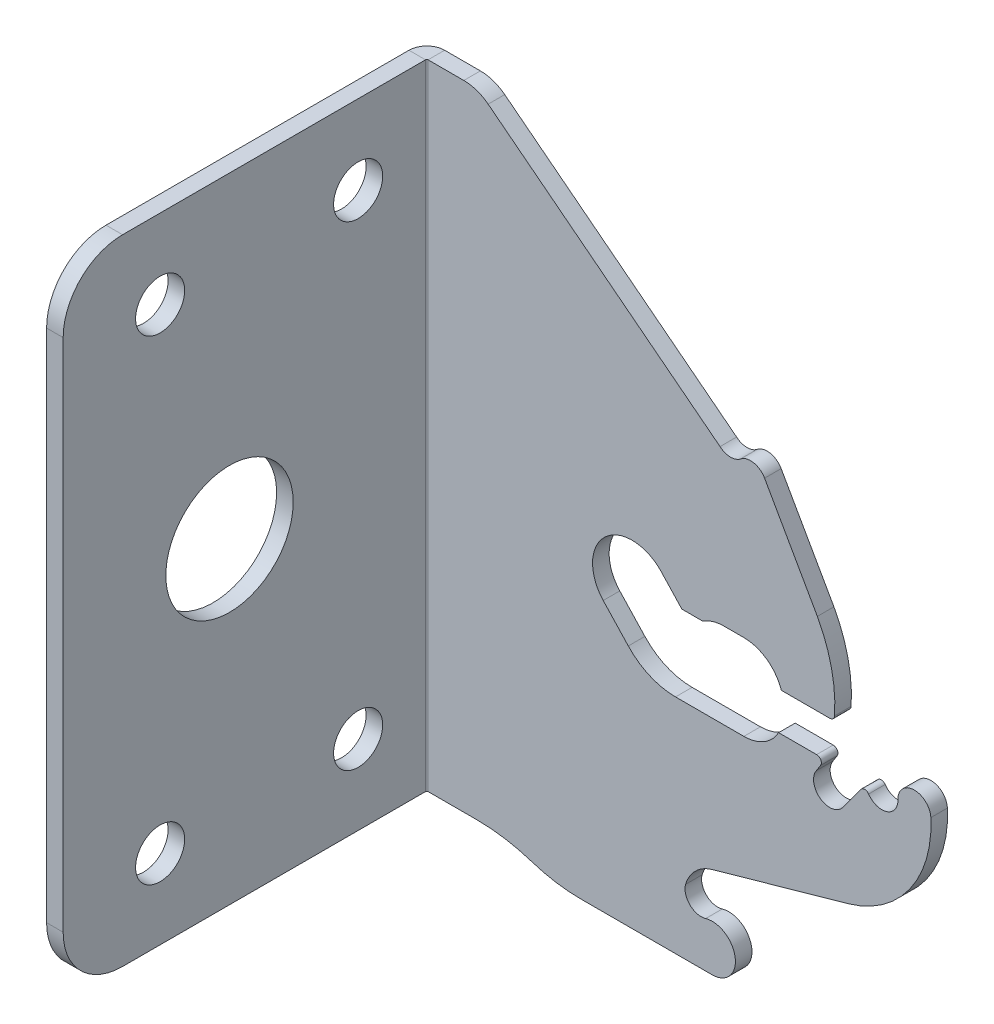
ISO-10303-21;
HEADER;
FILE_DESCRIPTION(('STEP AP214'),'2;1');
FILE_NAME('part.step','',(''),(''),'','','');
FILE_SCHEMA(('AUTOMOTIVE_DESIGN { 1 0 10303 214 1 1 1 1 }'));
ENDSEC;
DATA;
#1=APPLICATION_CONTEXT('core data for automotive mechanical design processes');
#2=APPLICATION_PROTOCOL_DEFINITION('international standard','automotive_design',2000,#1);
#3=PRODUCT_CONTEXT('',#1,'mechanical');
#4=PRODUCT('Part','Part','',(#3));
#5=PRODUCT_RELATED_PRODUCT_CATEGORY('part','',(#4));
#6=PRODUCT_DEFINITION_FORMATION('','',#4);
#7=PRODUCT_DEFINITION_CONTEXT('part definition',#1,'design');
#8=PRODUCT_DEFINITION('design','',#6,#7);
#9=PRODUCT_DEFINITION_SHAPE('','',#8);
#10=(LENGTH_UNIT() NAMED_UNIT(*) SI_UNIT(.MILLI.,.METRE.));
#11=(NAMED_UNIT(*) PLANE_ANGLE_UNIT() SI_UNIT($,.RADIAN.));
#12=(NAMED_UNIT(*) SI_UNIT($,.STERADIAN.) SOLID_ANGLE_UNIT());
#13=UNCERTAINTY_MEASURE_WITH_UNIT(LENGTH_MEASURE(1.E-05),#10,'distance_accuracy_value','');
#14=(GEOMETRIC_REPRESENTATION_CONTEXT(3) GLOBAL_UNCERTAINTY_ASSIGNED_CONTEXT((#13)) GLOBAL_UNIT_ASSIGNED_CONTEXT((#10,
#11,#12)) REPRESENTATION_CONTEXT('',''));
#15=CARTESIAN_POINT('',(0.,0.,0.));
#16=DIRECTION('',(0.,0.,1.));
#17=DIRECTION('',(1.,0.,0.));
#18=AXIS2_PLACEMENT_3D('',#15,#16,#17);
#19=CARTESIAN_POINT('',(0.,-50.805180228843,-2.65684));
#20=DIRECTION('',(0.,-1.,0.));
#21=DIRECTION('',(0.,0.,-1.));
#22=AXIS2_PLACEMENT_3D('',#19,#20,#21);
#23=PLANE('',#22);
#24=DIRECTION('',(1.,0.,0.));
#25=VECTOR('',#24,1.);
#26=CARTESIAN_POINT('',(0.,-50.805180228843,0.));
#27=LINE('',#26,#25);
#28=CARTESIAN_POINT('',(2.86004,-50.805180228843,0.));
#29=VERTEX_POINT('',#28);
#30=CARTESIAN_POINT('',(10.6283907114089,-50.805180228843,0.));
#31=VERTEX_POINT('',#30);
#32=EDGE_CURVE('E359',#29,#31,#27,.T.);
#33=ORIENTED_EDGE('',*,*,#32,.F.);
#34=DIRECTION('',(0.,0.,-1.));
#35=VECTOR('',#34,1.);
#36=CARTESIAN_POINT('',(2.86004,-50.805180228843,0.));
#37=LINE('',#36,#35);
#38=CARTESIAN_POINT('',(2.86004,-50.805180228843,-2.65684));
#39=VERTEX_POINT('',#38);
#40=EDGE_CURVE('E1178',#29,#39,#37,.T.);
#41=ORIENTED_EDGE('',*,*,#40,.T.);
#42=DIRECTION('',(1.,0.,0.));
#43=VECTOR('',#42,1.);
#44=CARTESIAN_POINT('',(0.,-50.805180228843,-2.65684));
#45=LINE('',#44,#43);
#46=CARTESIAN_POINT('',(10.6283907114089,-50.805180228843,-2.65684));
#47=VERTEX_POINT('',#46);
#48=EDGE_CURVE('E1202',#39,#47,#45,.T.);
#49=ORIENTED_EDGE('',*,*,#48,.T.);
#50=DIRECTION('',(0.,0.,1.));
#51=VECTOR('',#50,1.);
#52=CARTESIAN_POINT('',(10.6283907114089,-50.805180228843,-2.65684));
#53=LINE('',#52,#51);
#54=EDGE_CURVE('E508',#47,#31,#53,.T.);
#55=ORIENTED_EDGE('',*,*,#54,.T.);
#56=EDGE_LOOP('',(#33,#41,#49,#55));
#57=FACE_BOUND('',#56,.T.);
#58=ADVANCED_FACE('F75',(#57),#23,.T.);
#59=CARTESIAN_POINT('',(51.3611104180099,22.4565360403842,-2.65684));
#60=DIRECTION('',(0.,0.,1.));
#61=DIRECTION('',(1.,0.,0.));
#62=AXIS2_PLACEMENT_3D('',#59,#60,#61);
#63=PLANE('',#62);
#64=DIRECTION('',(0.,-1.,0.));
#65=VECTOR('',#64,1.);
#66=CARTESIAN_POINT('',(2.86004,-50.805180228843,-2.65684));
#67=LINE('',#66,#65);
#68=CARTESIAN_POINT('',(2.86004,50.8051802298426,-2.65684));
#69=VERTEX_POINT('',#68);
#70=EDGE_CURVE('E1172',#39,#69,#67,.F.);
#71=ORIENTED_EDGE('',*,*,#70,.T.);
#72=DIRECTION('',(-1.,0.,0.));
#73=VECTOR('',#72,1.);
#74=CARTESIAN_POINT('',(8.59326523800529,50.8051802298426,-2.65684));
#75=LINE('',#74,#73);
#76=CARTESIAN_POINT('',(8.59326523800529,50.8051802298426,-2.65684));
#77=VERTEX_POINT('',#76);
#78=EDGE_CURVE('E1199',#77,#69,#75,.T.);
#79=ORIENTED_EDGE('',*,*,#78,.F.);
#80=CARTESIAN_POINT('',(8.59326523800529,44.4551802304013,-2.65684));
#81=DIRECTION('',(0.,0.,1.));
#82=DIRECTION('',(1.,0.,0.));
#83=AXIS2_PLACEMENT_3D('',#80,#81,#82);
#84=CIRCLE('',#83,6.34999999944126);
#85=CARTESIAN_POINT('',(12.4952036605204,49.4649084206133,-2.65684));
#86=VERTEX_POINT('',#85);
#87=EDGE_CURVE('E1196',#86,#77,#84,.T.);
#88=ORIENTED_EDGE('',*,*,#87,.F.);
#89=DIRECTION('',(-0.78893357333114,0.614478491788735,0.));
#90=VECTOR('',#89,1.);
#91=CARTESIAN_POINT('',(12.4952036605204,49.4649084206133,-2.65684));
#92=LINE('',#91,#90);
#93=CARTESIAN_POINT('',(49.6710024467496,20.5097092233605,-2.65684));
#94=VERTEX_POINT('',#93);
#95=EDGE_CURVE('E1194',#94,#86,#92,.T.);
#96=ORIENTED_EDGE('',*,*,#95,.F.);
#97=CARTESIAN_POINT('',(51.3611104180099,22.4565360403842,-2.65684));
#98=DIRECTION('',(0.,0.,-1.));
#99=DIRECTION('',(1.,0.,0.));
#100=AXIS2_PLACEMENT_3D('',#97,#98,#99);
#101=CIRCLE('',#100,2.57810000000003);
#102=CARTESIAN_POINT('',(52.9664461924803,20.4392366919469,-2.65684));
#103=VERTEX_POINT('',#102);
#104=EDGE_CURVE('E450',#103,#94,#101,.T.);
#105=ORIENTED_EDGE('',*,*,#104,.F.);
#106=CARTESIAN_POINT('',(54.5717819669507,18.4219373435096,-2.65684));
#107=DIRECTION('',(0.,0.,1.));
#108=DIRECTION('',(1.,0.,0.));
#109=AXIS2_PLACEMENT_3D('',#106,#107,#108);
#110=CIRCLE('',#109,2.57810000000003);
#111=CARTESIAN_POINT('',(56.8159195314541,19.6909709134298,-2.65684));
#112=VERTEX_POINT('',#111);
#113=EDGE_CURVE('E337',#112,#103,#110,.T.);
#114=ORIENTED_EDGE('',*,*,#113,.F.);
#115=DIRECTION('',(-0.49223597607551,0.870461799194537,0.));
#116=VECTOR('',#115,1.);
#117=CARTESIAN_POINT('',(56.8159195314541,19.6909709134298,-2.65684));
#118=LINE('',#117,#116);
#119=CARTESIAN_POINT('',(65.2752117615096,4.73170118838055,-2.65684));
#120=VERTEX_POINT('',#119);
#121=EDGE_CURVE('E320',#120,#112,#118,.T.);
#122=ORIENTED_EDGE('',*,*,#121,.F.);
#123=CARTESIAN_POINT('',(45.2107386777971,-6.24782505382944,-2.65684));
#124=DIRECTION('',(0.,0.,1.));
#125=DIRECTION('',(1.,0.,0.));
#126=AXIS2_PLACEMENT_3D('',#123,#124,#125);
#127=CIRCLE('',#126,22.87210258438);
#128=CARTESIAN_POINT('',(68.0361227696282,-7.70896080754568,-2.65684));
#129=VERTEX_POINT('',#128);
#130=EDGE_CURVE('E335',#129,#120,#127,.T.);
#131=ORIENTED_EDGE('',*,*,#130,.F.);
#132=CARTESIAN_POINT('',(67.2756792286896,-7.66028205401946,-2.65684));
#133=DIRECTION('',(0.,0.,1.));
#134=DIRECTION('',(1.,0.,0.));
#135=AXIS2_PLACEMENT_3D('',#132,#133,#134);
#136=CIRCLE('',#135,0.761999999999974);
#137=CARTESIAN_POINT('',(67.2756792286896,-8.42228205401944,-2.65684));
#138=VERTEX_POINT('',#137);
#139=EDGE_CURVE('E340',#138,#129,#136,.T.);
#140=ORIENTED_EDGE('',*,*,#139,.F.);
#141=DIRECTION('',(1.,0.,0.));
#142=VECTOR('',#141,1.);
#143=CARTESIAN_POINT('',(59.5087073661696,-8.42228205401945,-2.65684));
#144=LINE('',#143,#142);
#145=CARTESIAN_POINT('',(59.5087073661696,-8.42228205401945,-2.65684));
#146=VERTEX_POINT('',#145);
#147=EDGE_CURVE('E342',#146,#138,#144,.T.);
#148=ORIENTED_EDGE('',*,*,#147,.F.);
#149=CARTESIAN_POINT('',(53.4926059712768,-10.4542820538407,-2.65684));
#150=DIRECTION('',(0.,0.,-1.));
#151=DIRECTION('',(1.,0.,0.));
#152=AXIS2_PLACEMENT_3D('',#149,#150,#151);
#153=CIRCLE('',#152,6.34999999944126);
#154=CARTESIAN_POINT('',(53.4926059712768,-4.10428205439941,-2.65684));
#155=VERTEX_POINT('',#154);
#156=EDGE_CURVE('E1279',#155,#146,#153,.T.);
#157=ORIENTED_EDGE('',*,*,#156,.F.);
#158=DIRECTION('',(1.,0.,0.));
#159=VECTOR('',#158,1.);
#160=CARTESIAN_POINT('',(53.4926059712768,-4.10428205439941,-2.65684));
#161=LINE('',#160,#159);
#162=CARTESIAN_POINT('',(50.3176059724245,-4.1042820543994,-2.65684));
#163=VERTEX_POINT('',#162);
#164=EDGE_CURVE('E1276',#163,#155,#161,.T.);
#165=ORIENTED_EDGE('',*,*,#164,.F.);
#166=CARTESIAN_POINT('',(50.3176059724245,-10.4542820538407,-2.65684));
#167=DIRECTION('',(0.,0.,-1.));
#168=DIRECTION('',(1.,0.,0.));
#169=AXIS2_PLACEMENT_3D('',#166,#167,#168);
#170=CIRCLE('',#169,6.34999999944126);
#171=CARTESIAN_POINT('',(46.8721823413,-5.12028205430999,-2.65684));
#172=VERTEX_POINT('',#171);
#173=EDGE_CURVE('E1273',#172,#163,#170,.T.);
#174=ORIENTED_EDGE('',*,*,#173,.F.);
#175=DIRECTION('',(1.,0.,0.));
#176=VECTOR('',#175,1.);
#177=CARTESIAN_POINT('',(43.55040852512,-5.12028205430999,-2.65684));
#178=LINE('',#177,#176);
#179=CARTESIAN_POINT('',(43.55040852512,-5.12028205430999,-2.65684));
#180=VERTEX_POINT('',#179);
#181=EDGE_CURVE('E1270',#180,#172,#178,.T.);
#182=ORIENTED_EDGE('',*,*,#181,.F.);
#183=DIRECTION('',(0.682628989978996,-0.730765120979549,0.));
#184=VECTOR('',#183,1.);
#185=CARTESIAN_POINT('',(40.2225752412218,-1.55778393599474,-2.65684));
#186=LINE('',#185,#184);
#187=CARTESIAN_POINT('',(40.2225752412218,-1.55778393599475,-2.65684));
#188=VERTEX_POINT('',#187);
#189=EDGE_CURVE('E1267',#188,#180,#186,.T.);
#190=ORIENTED_EDGE('',*,*,#189,.F.);
#191=CARTESIAN_POINT('',(35.58221672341,-5.89247802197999,-2.65684));
#192=DIRECTION('',(0.,0.,-1.));
#193=DIRECTION('',(1.,0.,0.));
#194=AXIS2_PLACEMENT_3D('',#191,#192,#193);
#195=CIRCLE('',#194,6.34999999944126);
#196=CARTESIAN_POINT('',(30.9418582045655,-10.2271721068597,-2.65684));
#197=VERTEX_POINT('',#196);
#198=EDGE_CURVE('E1264',#197,#188,#195,.T.);
#199=ORIENTED_EDGE('',*,*,#198,.F.);
#200=DIRECTION('',(-0.682628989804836,0.730765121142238,0.));
#201=VECTOR('',#200,1.);
#202=CARTESIAN_POINT('',(30.9418582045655,-10.2271721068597,-2.65684));
#203=LINE('',#202,#201);
#204=CARTESIAN_POINT('',(34.963833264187,-14.5327599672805,-2.65684));
#205=VERTEX_POINT('',#204);
#206=EDGE_CURVE('E1261',#205,#197,#203,.T.);
#207=ORIENTED_EDGE('',*,*,#206,.F.);
#208=CARTESIAN_POINT('',(42.5335431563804,-7.46167342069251,-2.65684));
#209=DIRECTION('',(0.,0.,-1.));
#210=DIRECTION('',(1.,0.,0.));
#211=AXIS2_PLACEMENT_3D('',#208,#209,#210);
#212=CIRCLE('',#211,10.3586086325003);
#213=CARTESIAN_POINT('',(42.5335431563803,-17.8202820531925,-2.65684));
#214=VERTEX_POINT('',#213);
#215=EDGE_CURVE('E1258',#214,#205,#212,.T.);
#216=ORIENTED_EDGE('',*,*,#215,.F.);
#217=DIRECTION('',(-1.,0.,0.));
#218=VECTOR('',#217,1.);
#219=CARTESIAN_POINT('',(42.5335431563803,-17.8202820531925,-2.65684));
#220=LINE('',#219,#218);
#221=CARTESIAN_POINT('',(53.4926059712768,-17.8202820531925,-2.65684));
#222=VERTEX_POINT('',#221);
#223=EDGE_CURVE('E1255',#222,#214,#220,.T.);
#224=ORIENTED_EDGE('',*,*,#223,.F.);
#225=CARTESIAN_POINT('',(53.4926059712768,-11.4702820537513,-2.65684));
#226=DIRECTION('',(0.,0.,-1.));
#227=DIRECTION('',(1.,0.,0.));
#228=AXIS2_PLACEMENT_3D('',#225,#226,#227);
#229=CIRCLE('',#228,6.34999999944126);
#230=CARTESIAN_POINT('',(59.0632608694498,-14.5182820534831,-2.65684));
#231=VERTEX_POINT('',#230);
#232=EDGE_CURVE('E1252',#231,#222,#229,.T.);
#233=ORIENTED_EDGE('',*,*,#232,.F.);
#234=DIRECTION('',(-1.,0.,0.));
#235=VECTOR('',#234,1.);
#236=CARTESIAN_POINT('',(59.0632608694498,-14.5182820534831,-2.65684));
#237=LINE('',#236,#235);
#238=CARTESIAN_POINT('',(65.1589075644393,-14.5182820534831,-2.65684));
#239=VERTEX_POINT('',#238);
#240=EDGE_CURVE('E1249',#239,#231,#237,.T.);
#241=ORIENTED_EDGE('',*,*,#240,.F.);
#242=CARTESIAN_POINT('',(65.1589075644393,-15.2802820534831,-2.65684));
#243=DIRECTION('',(0.,0.,1.));
#244=DIRECTION('',(1.,0.,0.));
#245=AXIS2_PLACEMENT_3D('',#242,#243,#244);
#246=CIRCLE('',#245,0.761999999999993);
#247=CARTESIAN_POINT('',(65.8014441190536,-15.6899047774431,-2.65684));
#248=VERTEX_POINT('',#247);
#249=EDGE_CURVE('E1246',#248,#239,#246,.T.);
#250=ORIENTED_EDGE('',*,*,#249,.F.);
#251=DIRECTION('',(0.537562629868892,0.843223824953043,0.));
#252=VECTOR('',#251,1.);
#253=CARTESIAN_POINT('',(65.1172245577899,-16.763175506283,-2.65684));
#254=LINE('',#253,#252);
#255=CARTESIAN_POINT('',(65.1172245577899,-16.763175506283,-2.65684));
#256=VERTEX_POINT('',#255);
#257=EDGE_CURVE('E1243',#256,#248,#254,.T.);
#258=ORIENTED_EDGE('',*,*,#257,.F.);
#259=CARTESIAN_POINT('',(67.2573958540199,-18.223222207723,-2.65684));
#260=DIRECTION('',(0.,0.,-1.));
#261=DIRECTION('',(1.,0.,0.));
#262=AXIS2_PLACEMENT_3D('',#259,#260,#261);
#263=CIRCLE('',#262,2.59076620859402);
#264=CARTESIAN_POINT('',(69.39756715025,-19.6832689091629,-2.65684));
#265=VERTEX_POINT('',#264);
#266=EDGE_CURVE('E1240',#265,#256,#263,.T.);
#267=ORIENTED_EDGE('',*,*,#266,.F.);
#268=DIRECTION('',(-0.592563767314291,-0.805523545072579,0.));
#269=VECTOR('',#268,1.);
#270=CARTESIAN_POINT('',(69.39756715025,-19.6832689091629,-2.65684));
#271=LINE('',#270,#269);
#272=CARTESIAN_POINT('',(72.2370476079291,-15.8233157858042,-2.65684));
#273=VERTEX_POINT('',#272);
#274=EDGE_CURVE('E1237',#273,#265,#271,.T.);
#275=ORIENTED_EDGE('',*,*,#274,.F.);
#276=CARTESIAN_POINT('',(72.8643164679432,-16.2559562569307,-2.65684));
#277=DIRECTION('',(0.,0.,1.));
#278=DIRECTION('',(1.,0.,0.));
#279=AXIS2_PLACEMENT_3D('',#276,#277,#278);
#280=CIRCLE('',#279,0.761999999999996);
#281=CARTESIAN_POINT('',(73.4917719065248,-15.8235864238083,-2.65684));
#282=VERTEX_POINT('',#281);
#283=EDGE_CURVE('E1234',#282,#273,#280,.T.);
#284=ORIENTED_EDGE('',*,*,#283,.F.);
#285=CARTESIAN_POINT('',(75.6146628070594,-14.3607351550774,-2.65684));
#286=DIRECTION('',(0.,0.,-1.));
#287=DIRECTION('',(1.,0.,0.));
#288=AXIS2_PLACEMENT_3D('',#285,#286,#287);
#289=CIRCLE('',#288,2.57810000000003);
#290=CARTESIAN_POINT('',(78.1875370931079,-14.5248007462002,-2.65684));
#291=VERTEX_POINT('',#290);
#292=EDGE_CURVE('E1231',#291,#282,#289,.T.);
#293=ORIENTED_EDGE('',*,*,#292,.F.);
#294=CARTESIAN_POINT('',(80.8239828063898,-14.250666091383,-2.65684));
#295=DIRECTION('',(0.,0.,1.));
#296=DIRECTION('',(1.,0.,0.));
#297=AXIS2_PLACEMENT_3D('',#294,#295,#296);
#298=CIRCLE('',#297,2.65065950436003);
#299=CARTESIAN_POINT('',(83.4709724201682,-14.1112322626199,-2.65684));
#300=VERTEX_POINT('',#299);
#301=EDGE_CURVE('E1228',#300,#291,#298,.T.);
#302=ORIENTED_EDGE('',*,*,#301,.F.);
#303=CARTESIAN_POINT('',(65.1668995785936,-15.0754245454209,-2.65684));
#304=DIRECTION('',(0.,0.,1.));
#305=DIRECTION('',(1.,0.,0.));
#306=AXIS2_PLACEMENT_3D('',#303,#304,#305);
#307=CIRCLE('',#306,18.32945032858);
#308=CARTESIAN_POINT('',(70.1446127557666,-32.7160345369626,-2.65684));
#309=VERTEX_POINT('',#308);
#310=EDGE_CURVE('E1225',#309,#300,#307,.T.);
#311=ORIENTED_EDGE('',*,*,#310,.F.);
#312=DIRECTION('',(0.962418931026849,0.271569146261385,0.));
#313=VECTOR('',#312,1.);
#314=CARTESIAN_POINT('',(70.1446127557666,-32.7160345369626,-2.65684));
#315=LINE('',#314,#313);
#316=CARTESIAN_POINT('',(48.4156542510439,-38.8473714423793,-2.65684));
#317=VERTEX_POINT('',#316);
#318=EDGE_CURVE('E1222',#317,#309,#315,.T.);
#319=ORIENTED_EDGE('',*,*,#318,.F.);
#320=CARTESIAN_POINT('',(50.1098774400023,-44.8515604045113,-2.65684));
#321=DIRECTION('',(0.,0.,-1.));
#322=DIRECTION('',(1.,0.,0.));
#323=AXIS2_PLACEMENT_3D('',#320,#321,#322);
#324=CIRCLE('',#323,6.23864386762);
#325=CARTESIAN_POINT('',(44.1369069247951,-43.0503662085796,-2.65684));
#326=VERTEX_POINT('',#325);
#327=EDGE_CURVE('E1219',#326,#317,#324,.T.);
#328=ORIENTED_EDGE('',*,*,#327,.F.);
#329=CARTESIAN_POINT('',(46.6477291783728,-43.6891277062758,-2.65684));
#330=DIRECTION('',(0.,0.,-1.));
#331=DIRECTION('',(1.,0.,0.));
#332=AXIS2_PLACEMENT_3D('',#329,#330,#331);
#333=CIRCLE('',#332,2.59080000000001);
#334=CARTESIAN_POINT('',(47.3723294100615,-46.1765358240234,-2.65684));
#335=VERTEX_POINT('',#334);
#336=EDGE_CURVE('E1216',#335,#326,#333,.T.);
#337=ORIENTED_EDGE('',*,*,#336,.F.);
#338=CARTESIAN_POINT('',(48.4133315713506,-49.750088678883,-2.65684));
#339=DIRECTION('',(0.,0.,1.));
#340=DIRECTION('',(1.,0.,0.));
#341=AXIS2_PLACEMENT_3D('',#338,#339,#340);
#342=CIRCLE('',#341,3.72209154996);
#343=CARTESIAN_POINT('',(48.4133315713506,-53.472180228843,-2.65684));
#344=VERTEX_POINT('',#343);
#345=EDGE_CURVE('E1213',#344,#335,#342,.T.);
#346=ORIENTED_EDGE('',*,*,#345,.F.);
#347=DIRECTION('',(1.,0.,0.));
#348=VECTOR('',#347,1.);
#349=CARTESIAN_POINT('',(27.3754606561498,-53.472180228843,-2.65684));
#350=LINE('',#349,#348);
#351=CARTESIAN_POINT('',(27.3754606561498,-53.472180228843,-2.65684));
#352=VERTEX_POINT('',#351);
#353=EDGE_CURVE('E1210',#352,#344,#350,.T.);
#354=ORIENTED_EDGE('',*,*,#353,.F.);
#355=CARTESIAN_POINT('',(27.3754606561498,-28.072180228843,-2.65684));
#356=DIRECTION('',(0.,0.,1.));
#357=DIRECTION('',(1.,0.,0.));
#358=AXIS2_PLACEMENT_3D('',#355,#356,#357);
#359=CIRCLE('',#358,25.4);
#360=CARTESIAN_POINT('',(19.4855688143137,-52.2157012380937,-2.65684));
#361=VERTEX_POINT('',#360);
#362=EDGE_CURVE('E1207',#361,#352,#359,.T.);
#363=ORIENTED_EDGE('',*,*,#362,.F.);
#364=CARTESIAN_POINT('',(10.6283907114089,-79.319173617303,-2.65684));
#365=DIRECTION('',(0.,0.,-1.));
#366=DIRECTION('',(1.,0.,0.));
#367=AXIS2_PLACEMENT_3D('',#364,#365,#366);
#368=CIRCLE('',#367,28.51399338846);
#369=EDGE_CURVE('E1204',#47,#361,#368,.T.);
#370=ORIENTED_EDGE('',*,*,#369,.F.);
#371=ORIENTED_EDGE('',*,*,#48,.F.);
#372=EDGE_LOOP('',(#71,#79,#88,#96,#105,#114,#122,#131,#140,#148,#157,#165,#174,#182,#190,#199,
#207,#216,#224,#233,#241,#250,#258,#267,#275,#284,#293,#302,#311,#319,#328,#337,#346,#354,#363,
#370,#371));
#373=FACE_BOUND('',#372,.T.);
#374=ADVANCED_FACE('F333',(#373),#63,.F.);
#375=CARTESIAN_POINT('',(51.3611104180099,22.4565360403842,0.));
#376=DIRECTION('',(0.,0.,1.));
#377=DIRECTION('',(1.,0.,0.));
#378=AXIS2_PLACEMENT_3D('',#375,#376,#377);
#379=PLANE('',#378);
#380=DIRECTION('',(-1.,0.,0.));
#381=VECTOR('',#380,1.);
#382=CARTESIAN_POINT('',(8.59326523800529,50.8051802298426,0.));
#383=LINE('',#382,#381);
#384=CARTESIAN_POINT('',(8.59326523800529,50.8051802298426,0.));
#385=VERTEX_POINT('',#384);
#386=CARTESIAN_POINT('',(2.86004,50.8051802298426,0.));
#387=VERTEX_POINT('',#386);
#388=EDGE_CURVE('E357',#385,#387,#383,.T.);
#389=ORIENTED_EDGE('',*,*,#388,.T.);
#390=DIRECTION('',(0.,-1.,0.));
#391=VECTOR('',#390,1.);
#392=CARTESIAN_POINT('',(2.86004,-50.805180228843,0.));
#393=LINE('',#392,#391);
#394=EDGE_CURVE('E92',#29,#387,#393,.F.);
#395=ORIENTED_EDGE('',*,*,#394,.F.);
#396=ORIENTED_EDGE('',*,*,#32,.T.);
#397=CARTESIAN_POINT('',(10.6283907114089,-79.319173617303,0.));
#398=DIRECTION('',(0.,0.,-1.));
#399=DIRECTION('',(1.,0.,0.));
#400=AXIS2_PLACEMENT_3D('',#397,#398,#399);
#401=CIRCLE('',#400,28.51399338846);
#402=CARTESIAN_POINT('',(19.4855688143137,-52.2157012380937,0.));
#403=VERTEX_POINT('',#402);
#404=EDGE_CURVE('E361',#31,#403,#401,.T.);
#405=ORIENTED_EDGE('',*,*,#404,.T.);
#406=CARTESIAN_POINT('',(27.3754606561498,-28.072180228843,0.));
#407=DIRECTION('',(0.,0.,1.));
#408=DIRECTION('',(1.,0.,0.));
#409=AXIS2_PLACEMENT_3D('',#406,#407,#408);
#410=CIRCLE('',#409,25.4);
#411=CARTESIAN_POINT('',(27.3754606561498,-53.472180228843,0.));
#412=VERTEX_POINT('',#411);
#413=EDGE_CURVE('E364',#403,#412,#410,.T.);
#414=ORIENTED_EDGE('',*,*,#413,.T.);
#415=DIRECTION('',(1.,0.,0.));
#416=VECTOR('',#415,1.);
#417=CARTESIAN_POINT('',(27.3754606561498,-53.472180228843,0.));
#418=LINE('',#417,#416);
#419=CARTESIAN_POINT('',(48.4133315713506,-53.472180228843,0.));
#420=VERTEX_POINT('',#419);
#421=EDGE_CURVE('E367',#412,#420,#418,.T.);
#422=ORIENTED_EDGE('',*,*,#421,.T.);
#423=CARTESIAN_POINT('',(48.4133315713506,-49.750088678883,0.));
#424=DIRECTION('',(0.,0.,1.));
#425=DIRECTION('',(1.,0.,0.));
#426=AXIS2_PLACEMENT_3D('',#423,#424,#425);
#427=CIRCLE('',#426,3.72209154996);
#428=CARTESIAN_POINT('',(47.3723294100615,-46.1765358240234,0.));
#429=VERTEX_POINT('',#428);
#430=EDGE_CURVE('E370',#420,#429,#427,.T.);
#431=ORIENTED_EDGE('',*,*,#430,.T.);
#432=CARTESIAN_POINT('',(46.6477291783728,-43.6891277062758,0.));
#433=DIRECTION('',(0.,0.,-1.));
#434=DIRECTION('',(1.,0.,0.));
#435=AXIS2_PLACEMENT_3D('',#432,#433,#434);
#436=CIRCLE('',#435,2.59080000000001);
#437=CARTESIAN_POINT('',(44.1369069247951,-43.0503662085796,0.));
#438=VERTEX_POINT('',#437);
#439=EDGE_CURVE('E373',#429,#438,#436,.T.);
#440=ORIENTED_EDGE('',*,*,#439,.T.);
#441=CARTESIAN_POINT('',(50.1098774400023,-44.8515604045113,0.));
#442=DIRECTION('',(0.,0.,-1.));
#443=DIRECTION('',(1.,0.,0.));
#444=AXIS2_PLACEMENT_3D('',#441,#442,#443);
#445=CIRCLE('',#444,6.23864386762);
#446=CARTESIAN_POINT('',(48.4156542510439,-38.8473714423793,0.));
#447=VERTEX_POINT('',#446);
#448=EDGE_CURVE('E376',#438,#447,#445,.T.);
#449=ORIENTED_EDGE('',*,*,#448,.T.);
#450=DIRECTION('',(0.962418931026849,0.271569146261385,0.));
#451=VECTOR('',#450,1.);
#452=CARTESIAN_POINT('',(70.1446127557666,-32.7160345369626,0.));
#453=LINE('',#452,#451);
#454=CARTESIAN_POINT('',(70.1446127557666,-32.7160345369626,0.));
#455=VERTEX_POINT('',#454);
#456=EDGE_CURVE('E379',#447,#455,#453,.T.);
#457=ORIENTED_EDGE('',*,*,#456,.T.);
#458=CARTESIAN_POINT('',(65.1668995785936,-15.0754245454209,0.));
#459=DIRECTION('',(0.,0.,1.));
#460=DIRECTION('',(1.,0.,0.));
#461=AXIS2_PLACEMENT_3D('',#458,#459,#460);
#462=CIRCLE('',#461,18.32945032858);
#463=CARTESIAN_POINT('',(83.4709724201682,-14.1112322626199,0.));
#464=VERTEX_POINT('',#463);
#465=EDGE_CURVE('E382',#455,#464,#462,.T.);
#466=ORIENTED_EDGE('',*,*,#465,.T.);
#467=CARTESIAN_POINT('',(80.8239828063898,-14.250666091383,0.));
#468=DIRECTION('',(0.,0.,1.));
#469=DIRECTION('',(1.,0.,0.));
#470=AXIS2_PLACEMENT_3D('',#467,#468,#469);
#471=CIRCLE('',#470,2.65065950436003);
#472=CARTESIAN_POINT('',(78.1875370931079,-14.5248007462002,0.));
#473=VERTEX_POINT('',#472);
#474=EDGE_CURVE('E385',#464,#473,#471,.T.);
#475=ORIENTED_EDGE('',*,*,#474,.T.);
#476=CARTESIAN_POINT('',(75.6146628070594,-14.3607351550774,0.));
#477=DIRECTION('',(0.,0.,-1.));
#478=DIRECTION('',(1.,0.,0.));
#479=AXIS2_PLACEMENT_3D('',#476,#477,#478);
#480=CIRCLE('',#479,2.57810000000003);
#481=CARTESIAN_POINT('',(73.4917719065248,-15.8235864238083,0.));
#482=VERTEX_POINT('',#481);
#483=EDGE_CURVE('E388',#473,#482,#480,.T.);
#484=ORIENTED_EDGE('',*,*,#483,.T.);
#485=CARTESIAN_POINT('',(72.8643164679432,-16.2559562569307,0.));
#486=DIRECTION('',(0.,0.,1.));
#487=DIRECTION('',(1.,0.,0.));
#488=AXIS2_PLACEMENT_3D('',#485,#486,#487);
#489=CIRCLE('',#488,0.761999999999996);
#490=CARTESIAN_POINT('',(72.2370476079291,-15.8233157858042,0.));
#491=VERTEX_POINT('',#490);
#492=EDGE_CURVE('E391',#482,#491,#489,.T.);
#493=ORIENTED_EDGE('',*,*,#492,.T.);
#494=DIRECTION('',(-0.592563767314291,-0.805523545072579,0.));
#495=VECTOR('',#494,1.);
#496=CARTESIAN_POINT('',(69.39756715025,-19.6832689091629,0.));
#497=LINE('',#496,#495);
#498=CARTESIAN_POINT('',(69.39756715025,-19.6832689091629,0.));
#499=VERTEX_POINT('',#498);
#500=EDGE_CURVE('E394',#491,#499,#497,.T.);
#501=ORIENTED_EDGE('',*,*,#500,.T.);
#502=CARTESIAN_POINT('',(67.2573958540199,-18.223222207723,0.));
#503=DIRECTION('',(0.,0.,-1.));
#504=DIRECTION('',(1.,0.,0.));
#505=AXIS2_PLACEMENT_3D('',#502,#503,#504);
#506=CIRCLE('',#505,2.59076620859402);
#507=CARTESIAN_POINT('',(65.1172245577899,-16.763175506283,0.));
#508=VERTEX_POINT('',#507);
#509=EDGE_CURVE('E397',#499,#508,#506,.T.);
#510=ORIENTED_EDGE('',*,*,#509,.T.);
#511=DIRECTION('',(0.537562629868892,0.843223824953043,0.));
#512=VECTOR('',#511,1.);
#513=CARTESIAN_POINT('',(65.1172245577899,-16.763175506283,0.));
#514=LINE('',#513,#512);
#515=CARTESIAN_POINT('',(65.8014441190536,-15.6899047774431,0.));
#516=VERTEX_POINT('',#515);
#517=EDGE_CURVE('E400',#508,#516,#514,.T.);
#518=ORIENTED_EDGE('',*,*,#517,.T.);
#519=CARTESIAN_POINT('',(65.1589075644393,-15.2802820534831,0.));
#520=DIRECTION('',(0.,0.,1.));
#521=DIRECTION('',(1.,0.,0.));
#522=AXIS2_PLACEMENT_3D('',#519,#520,#521);
#523=CIRCLE('',#522,0.761999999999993);
#524=CARTESIAN_POINT('',(65.1589075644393,-14.5182820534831,0.));
#525=VERTEX_POINT('',#524);
#526=EDGE_CURVE('E403',#516,#525,#523,.T.);
#527=ORIENTED_EDGE('',*,*,#526,.T.);
#528=DIRECTION('',(-1.,0.,0.));
#529=VECTOR('',#528,1.);
#530=CARTESIAN_POINT('',(59.0632608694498,-14.5182820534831,0.));
#531=LINE('',#530,#529);
#532=CARTESIAN_POINT('',(59.0632608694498,-14.5182820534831,0.));
#533=VERTEX_POINT('',#532);
#534=EDGE_CURVE('E406',#525,#533,#531,.T.);
#535=ORIENTED_EDGE('',*,*,#534,.T.);
#536=CARTESIAN_POINT('',(53.4926059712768,-11.4702820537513,0.));
#537=DIRECTION('',(0.,0.,-1.));
#538=DIRECTION('',(1.,0.,0.));
#539=AXIS2_PLACEMENT_3D('',#536,#537,#538);
#540=CIRCLE('',#539,6.34999999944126);
#541=CARTESIAN_POINT('',(53.4926059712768,-17.8202820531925,0.));
#542=VERTEX_POINT('',#541);
#543=EDGE_CURVE('E409',#533,#542,#540,.T.);
#544=ORIENTED_EDGE('',*,*,#543,.T.);
#545=DIRECTION('',(-1.,0.,0.));
#546=VECTOR('',#545,1.);
#547=CARTESIAN_POINT('',(42.5335431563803,-17.8202820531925,0.));
#548=LINE('',#547,#546);
#549=CARTESIAN_POINT('',(42.5335431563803,-17.8202820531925,0.));
#550=VERTEX_POINT('',#549);
#551=EDGE_CURVE('E412',#542,#550,#548,.T.);
#552=ORIENTED_EDGE('',*,*,#551,.T.);
#553=CARTESIAN_POINT('',(42.5335431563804,-7.46167342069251,0.));
#554=DIRECTION('',(0.,0.,-1.));
#555=DIRECTION('',(1.,0.,0.));
#556=AXIS2_PLACEMENT_3D('',#553,#554,#555);
#557=CIRCLE('',#556,10.3586086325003);
#558=CARTESIAN_POINT('',(34.963833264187,-14.5327599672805,0.));
#559=VERTEX_POINT('',#558);
#560=EDGE_CURVE('E415',#550,#559,#557,.T.);
#561=ORIENTED_EDGE('',*,*,#560,.T.);
#562=DIRECTION('',(-0.682628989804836,0.730765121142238,0.));
#563=VECTOR('',#562,1.);
#564=CARTESIAN_POINT('',(30.9418582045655,-10.2271721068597,0.));
#565=LINE('',#564,#563);
#566=CARTESIAN_POINT('',(30.9418582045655,-10.2271721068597,0.));
#567=VERTEX_POINT('',#566);
#568=EDGE_CURVE('E418',#559,#567,#565,.T.);
#569=ORIENTED_EDGE('',*,*,#568,.T.);
#570=CARTESIAN_POINT('',(35.58221672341,-5.89247802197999,0.));
#571=DIRECTION('',(0.,0.,-1.));
#572=DIRECTION('',(1.,0.,0.));
#573=AXIS2_PLACEMENT_3D('',#570,#571,#572);
#574=CIRCLE('',#573,6.34999999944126);
#575=CARTESIAN_POINT('',(40.2225752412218,-1.55778393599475,0.));
#576=VERTEX_POINT('',#575);
#577=EDGE_CURVE('E421',#567,#576,#574,.T.);
#578=ORIENTED_EDGE('',*,*,#577,.T.);
#579=DIRECTION('',(0.682628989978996,-0.730765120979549,0.));
#580=VECTOR('',#579,1.);
#581=CARTESIAN_POINT('',(40.2225752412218,-1.55778393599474,0.));
#582=LINE('',#581,#580);
#583=CARTESIAN_POINT('',(43.55040852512,-5.12028205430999,0.));
#584=VERTEX_POINT('',#583);
#585=EDGE_CURVE('E424',#576,#584,#582,.T.);
#586=ORIENTED_EDGE('',*,*,#585,.T.);
#587=DIRECTION('',(1.,0.,0.));
#588=VECTOR('',#587,1.);
#589=CARTESIAN_POINT('',(43.55040852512,-5.12028205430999,0.));
#590=LINE('',#589,#588);
#591=CARTESIAN_POINT('',(46.8721823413,-5.12028205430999,0.));
#592=VERTEX_POINT('',#591);
#593=EDGE_CURVE('E427',#584,#592,#590,.T.);
#594=ORIENTED_EDGE('',*,*,#593,.T.);
#595=CARTESIAN_POINT('',(50.3176059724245,-10.4542820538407,0.));
#596=DIRECTION('',(0.,0.,-1.));
#597=DIRECTION('',(1.,0.,0.));
#598=AXIS2_PLACEMENT_3D('',#595,#596,#597);
#599=CIRCLE('',#598,6.34999999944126);
#600=CARTESIAN_POINT('',(50.3176059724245,-4.1042820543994,0.));
#601=VERTEX_POINT('',#600);
#602=EDGE_CURVE('E430',#592,#601,#599,.T.);
#603=ORIENTED_EDGE('',*,*,#602,.T.);
#604=DIRECTION('',(1.,0.,0.));
#605=VECTOR('',#604,1.);
#606=CARTESIAN_POINT('',(53.4926059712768,-4.10428205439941,0.));
#607=LINE('',#606,#605);
#608=CARTESIAN_POINT('',(53.4926059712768,-4.10428205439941,0.));
#609=VERTEX_POINT('',#608);
#610=EDGE_CURVE('E433',#601,#609,#607,.T.);
#611=ORIENTED_EDGE('',*,*,#610,.T.);
#612=CARTESIAN_POINT('',(53.4926059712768,-10.4542820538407,0.));
#613=DIRECTION('',(0.,0.,-1.));
#614=DIRECTION('',(1.,0.,0.));
#615=AXIS2_PLACEMENT_3D('',#612,#613,#614);
#616=CIRCLE('',#615,6.34999999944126);
#617=CARTESIAN_POINT('',(59.5087073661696,-8.42228205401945,0.));
#618=VERTEX_POINT('',#617);
#619=EDGE_CURVE('E436',#609,#618,#616,.T.);
#620=ORIENTED_EDGE('',*,*,#619,.T.);
#621=DIRECTION('',(1.,0.,0.));
#622=VECTOR('',#621,1.);
#623=CARTESIAN_POINT('',(59.5087073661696,-8.42228205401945,0.));
#624=LINE('',#623,#622);
#625=CARTESIAN_POINT('',(67.2756792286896,-8.42228205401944,0.));
#626=VERTEX_POINT('',#625);
#627=EDGE_CURVE('E439',#618,#626,#624,.T.);
#628=ORIENTED_EDGE('',*,*,#627,.T.);
#629=CARTESIAN_POINT('',(67.2756792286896,-7.66028205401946,0.));
#630=DIRECTION('',(0.,0.,1.));
#631=DIRECTION('',(1.,0.,0.));
#632=AXIS2_PLACEMENT_3D('',#629,#630,#631);
#633=CIRCLE('',#632,0.761999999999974);
#634=CARTESIAN_POINT('',(68.0361227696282,-7.70896080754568,0.));
#635=VERTEX_POINT('',#634);
#636=EDGE_CURVE('E442',#626,#635,#633,.T.);
#637=ORIENTED_EDGE('',*,*,#636,.T.);
#638=CARTESIAN_POINT('',(45.2107386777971,-6.24782505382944,0.));
#639=DIRECTION('',(0.,0.,1.));
#640=DIRECTION('',(1.,0.,0.));
#641=AXIS2_PLACEMENT_3D('',#638,#639,#640);
#642=CIRCLE('',#641,22.87210258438);
#643=CARTESIAN_POINT('',(65.2752117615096,4.73170118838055,0.));
#644=VERTEX_POINT('',#643);
#645=EDGE_CURVE('E445',#635,#644,#642,.T.);
#646=ORIENTED_EDGE('',*,*,#645,.T.);
#647=DIRECTION('',(-0.49223597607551,0.870461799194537,0.));
#648=VECTOR('',#647,1.);
#649=CARTESIAN_POINT('',(56.8159195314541,19.6909709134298,0.));
#650=LINE('',#649,#648);
#651=CARTESIAN_POINT('',(56.8159195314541,19.6909709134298,0.));
#652=VERTEX_POINT('',#651);
#653=EDGE_CURVE('E323',#644,#652,#650,.T.);
#654=ORIENTED_EDGE('',*,*,#653,.T.);
#655=CARTESIAN_POINT('',(54.5717819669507,18.4219373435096,0.));
#656=DIRECTION('',(0.,0.,1.));
#657=DIRECTION('',(1.,0.,0.));
#658=AXIS2_PLACEMENT_3D('',#655,#656,#657);
#659=CIRCLE('',#658,2.57810000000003);
#660=CARTESIAN_POINT('',(52.9664461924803,20.4392366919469,0.));
#661=VERTEX_POINT('',#660);
#662=EDGE_CURVE('E448',#652,#661,#659,.T.);
#663=ORIENTED_EDGE('',*,*,#662,.T.);
#664=CARTESIAN_POINT('',(51.3611104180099,22.4565360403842,0.));
#665=DIRECTION('',(0.,0.,-1.));
#666=DIRECTION('',(1.,0.,0.));
#667=AXIS2_PLACEMENT_3D('',#664,#665,#666);
#668=CIRCLE('',#667,2.57810000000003);
#669=CARTESIAN_POINT('',(49.6710024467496,20.5097092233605,0.));
#670=VERTEX_POINT('',#669);
#671=EDGE_CURVE('E347',#661,#670,#668,.T.);
#672=ORIENTED_EDGE('',*,*,#671,.T.);
#673=DIRECTION('',(-0.78893357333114,0.614478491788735,0.));
#674=VECTOR('',#673,1.);
#675=CARTESIAN_POINT('',(12.4952036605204,49.4649084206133,0.));
#676=LINE('',#675,#674);
#677=CARTESIAN_POINT('',(12.4952036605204,49.4649084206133,0.));
#678=VERTEX_POINT('',#677);
#679=EDGE_CURVE('E350',#670,#678,#676,.T.);
#680=ORIENTED_EDGE('',*,*,#679,.T.);
#681=CARTESIAN_POINT('',(8.59326523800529,44.4551802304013,0.));
#682=DIRECTION('',(0.,0.,1.));
#683=DIRECTION('',(1.,0.,0.));
#684=AXIS2_PLACEMENT_3D('',#681,#682,#683);
#685=CIRCLE('',#684,6.34999999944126);
#686=EDGE_CURVE('E354',#678,#385,#685,.T.);
#687=ORIENTED_EDGE('',*,*,#686,.T.);
#688=EDGE_LOOP('',(#389,#395,#396,#405,#414,#422,#431,#440,#449,#457,#466,#475,#484,#493,#501,
#510,#518,#527,#535,#544,#552,#561,#569,#578,#586,#594,#603,#611,#620,#628,#637,#646,#654,#663,
#672,#680,#687));
#689=FACE_BOUND('',#688,.T.);
#690=ADVANCED_FACE('F515',(#689),#379,.T.);
#691=CARTESIAN_POINT('',(51.3611104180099,22.4565360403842,-2.65684));
#692=DIRECTION('',(0.,0.,1.));
#693=DIRECTION('',(1.,0.,0.));
#694=AXIS2_PLACEMENT_3D('',#691,#692,#693);
#695=CYLINDRICAL_SURFACE('',#694,2.57810000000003);
#696=ORIENTED_EDGE('',*,*,#671,.F.);
#697=DIRECTION('',(0.,0.,1.));
#698=VECTOR('',#697,1.);
#699=CARTESIAN_POINT('',(52.9664461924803,20.4392366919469,-2.65684));
#700=LINE('',#699,#698);
#701=EDGE_CURVE('E13',#103,#661,#700,.T.);
#702=ORIENTED_EDGE('',*,*,#701,.F.);
#703=ORIENTED_EDGE('',*,*,#104,.T.);
#704=DIRECTION('',(0.,0.,1.));
#705=VECTOR('',#704,1.);
#706=CARTESIAN_POINT('',(49.6710024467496,20.5097092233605,-2.65684));
#707=LINE('',#706,#705);
#708=EDGE_CURVE('E79',#94,#670,#707,.T.);
#709=ORIENTED_EDGE('',*,*,#708,.T.);
#710=EDGE_LOOP('',(#696,#702,#703,#709));
#711=FACE_BOUND('',#710,.T.);
#712=ADVANCED_FACE('F77',(#711),#695,.F.);
#713=CARTESIAN_POINT('',(54.5717819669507,18.4219373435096,-2.65684));
#714=DIRECTION('',(0.,0.,1.));
#715=DIRECTION('',(1.,0.,0.));
#716=AXIS2_PLACEMENT_3D('',#713,#714,#715);
#717=CYLINDRICAL_SURFACE('',#716,2.57810000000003);
#718=ORIENTED_EDGE('',*,*,#662,.F.);
#719=DIRECTION('',(0.,0.,1.));
#720=VECTOR('',#719,1.);
#721=CARTESIAN_POINT('',(56.8159195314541,19.6909709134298,-2.65684));
#722=LINE('',#721,#720);
#723=EDGE_CURVE('E84',#112,#652,#722,.T.);
#724=ORIENTED_EDGE('',*,*,#723,.F.);
#725=ORIENTED_EDGE('',*,*,#113,.T.);
#726=ORIENTED_EDGE('',*,*,#701,.T.);
#727=EDGE_LOOP('',(#718,#724,#725,#726));
#728=FACE_BOUND('',#727,.T.);
#729=ADVANCED_FACE('F516',(#728),#717,.T.);
#730=CARTESIAN_POINT('',(56.8159195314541,19.6909709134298,-2.65684));
#731=DIRECTION('',(0.870461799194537,0.49223597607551,0.));
#732=DIRECTION('',(-0.49223597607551,0.870461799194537,0.));
#733=AXIS2_PLACEMENT_3D('',#730,#731,#732);
#734=PLANE('',#733);
#735=ORIENTED_EDGE('',*,*,#653,.F.);
#736=DIRECTION('',(0.,0.,1.));
#737=VECTOR('',#736,1.);
#738=CARTESIAN_POINT('',(65.2752117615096,4.73170118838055,-2.65684));
#739=LINE('',#738,#737);
#740=EDGE_CURVE('E317',#120,#644,#739,.T.);
#741=ORIENTED_EDGE('',*,*,#740,.F.);
#742=ORIENTED_EDGE('',*,*,#121,.T.);
#743=ORIENTED_EDGE('',*,*,#723,.T.);
#744=EDGE_LOOP('',(#735,#741,#742,#743));
#745=FACE_BOUND('',#744,.T.);
#746=ADVANCED_FACE('F319',(#745),#734,.T.);
#747=CARTESIAN_POINT('',(45.2107386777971,-6.24782505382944,-2.65684));
#748=DIRECTION('',(0.,0.,1.));
#749=DIRECTION('',(1.,0.,0.));
#750=AXIS2_PLACEMENT_3D('',#747,#748,#749);
#751=CYLINDRICAL_SURFACE('',#750,22.87210258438);
#752=ORIENTED_EDGE('',*,*,#645,.F.);
#753=DIRECTION('',(0.,0.,1.));
#754=VECTOR('',#753,1.);
#755=CARTESIAN_POINT('',(68.0361227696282,-7.70896080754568,-2.65684));
#756=LINE('',#755,#754);
#757=EDGE_CURVE('E328',#129,#635,#756,.T.);
#758=ORIENTED_EDGE('',*,*,#757,.F.);
#759=ORIENTED_EDGE('',*,*,#130,.T.);
#760=ORIENTED_EDGE('',*,*,#740,.T.);
#761=EDGE_LOOP('',(#752,#758,#759,#760));
#762=FACE_BOUND('',#761,.T.);
#763=ADVANCED_FACE('F339',(#762),#751,.T.);
#764=CARTESIAN_POINT('',(67.2756792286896,-7.66028205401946,-2.65684));
#765=DIRECTION('',(0.,0.,1.));
#766=DIRECTION('',(1.,0.,0.));
#767=AXIS2_PLACEMENT_3D('',#764,#765,#766);
#768=CYLINDRICAL_SURFACE('',#767,0.761999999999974);
#769=ORIENTED_EDGE('',*,*,#636,.F.);
#770=DIRECTION('',(0.,0.,1.));
#771=VECTOR('',#770,1.);
#772=CARTESIAN_POINT('',(67.2756792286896,-8.42228205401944,-2.65684));
#773=LINE('',#772,#771);
#774=EDGE_CURVE('E454',#138,#626,#773,.T.);
#775=ORIENTED_EDGE('',*,*,#774,.F.);
#776=ORIENTED_EDGE('',*,*,#139,.T.);
#777=ORIENTED_EDGE('',*,*,#757,.T.);
#778=EDGE_LOOP('',(#769,#775,#776,#777));
#779=FACE_BOUND('',#778,.T.);
#780=ADVANCED_FACE('F593',(#779),#768,.T.);
#781=CARTESIAN_POINT('',(59.5087073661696,-8.42228205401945,-2.65684));
#782=DIRECTION('',(0.,-1.,0.));
#783=DIRECTION('',(1.,0.,0.));
#784=AXIS2_PLACEMENT_3D('',#781,#782,#783);
#785=PLANE('',#784);
#786=ORIENTED_EDGE('',*,*,#627,.F.);
#787=DIRECTION('',(0.,0.,1.));
#788=VECTOR('',#787,1.);
#789=CARTESIAN_POINT('',(59.5087073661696,-8.42228205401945,-2.65684));
#790=LINE('',#789,#788);
#791=EDGE_CURVE('E456',#146,#618,#790,.T.);
#792=ORIENTED_EDGE('',*,*,#791,.F.);
#793=ORIENTED_EDGE('',*,*,#147,.T.);
#794=ORIENTED_EDGE('',*,*,#774,.T.);
#795=EDGE_LOOP('',(#786,#792,#793,#794));
#796=FACE_BOUND('',#795,.T.);
#797=ADVANCED_FACE('F603',(#796),#785,.T.);
#798=CARTESIAN_POINT('',(53.4926059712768,-10.4542820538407,-2.65684));
#799=DIRECTION('',(0.,0.,1.));
#800=DIRECTION('',(1.,0.,0.));
#801=AXIS2_PLACEMENT_3D('',#798,#799,#800);
#802=CYLINDRICAL_SURFACE('',#801,6.34999999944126);
#803=ORIENTED_EDGE('',*,*,#619,.F.);
#804=DIRECTION('',(0.,0.,1.));
#805=VECTOR('',#804,1.);
#806=CARTESIAN_POINT('',(53.4926059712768,-4.10428205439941,-2.65684));
#807=LINE('',#806,#805);
#808=EDGE_CURVE('E458',#155,#609,#807,.T.);
#809=ORIENTED_EDGE('',*,*,#808,.F.);
#810=ORIENTED_EDGE('',*,*,#156,.T.);
#811=ORIENTED_EDGE('',*,*,#791,.T.);
#812=EDGE_LOOP('',(#803,#809,#810,#811));
#813=FACE_BOUND('',#812,.T.);
#814=ADVANCED_FACE('F614',(#813),#802,.F.);
#815=CARTESIAN_POINT('',(53.4926059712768,-4.10428205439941,-2.65684));
#816=DIRECTION('',(0.,-1.,0.));
#817=DIRECTION('',(1.,0.,0.));
#818=AXIS2_PLACEMENT_3D('',#815,#816,#817);
#819=PLANE('',#818);
#820=ORIENTED_EDGE('',*,*,#610,.F.);
#821=DIRECTION('',(0.,0.,1.));
#822=VECTOR('',#821,1.);
#823=CARTESIAN_POINT('',(50.3176059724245,-4.1042820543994,-2.65684));
#824=LINE('',#823,#822);
#825=EDGE_CURVE('E460',#163,#601,#824,.T.);
#826=ORIENTED_EDGE('',*,*,#825,.F.);
#827=ORIENTED_EDGE('',*,*,#164,.T.);
#828=ORIENTED_EDGE('',*,*,#808,.T.);
#829=EDGE_LOOP('',(#820,#826,#827,#828));
#830=FACE_BOUND('',#829,.T.);
#831=ADVANCED_FACE('F625',(#830),#819,.T.);
#832=CARTESIAN_POINT('',(50.3176059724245,-10.4542820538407,-2.65684));
#833=DIRECTION('',(0.,0.,1.));
#834=DIRECTION('',(1.,0.,0.));
#835=AXIS2_PLACEMENT_3D('',#832,#833,#834);
#836=CYLINDRICAL_SURFACE('',#835,6.34999999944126);
#837=ORIENTED_EDGE('',*,*,#602,.F.);
#838=DIRECTION('',(0.,0.,1.));
#839=VECTOR('',#838,1.);
#840=CARTESIAN_POINT('',(46.8721823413,-5.12028205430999,-2.65684));
#841=LINE('',#840,#839);
#842=EDGE_CURVE('E462',#172,#592,#841,.T.);
#843=ORIENTED_EDGE('',*,*,#842,.F.);
#844=ORIENTED_EDGE('',*,*,#173,.T.);
#845=ORIENTED_EDGE('',*,*,#825,.T.);
#846=EDGE_LOOP('',(#837,#843,#844,#845));
#847=FACE_BOUND('',#846,.T.);
#848=ADVANCED_FACE('F636',(#847),#836,.F.);
#849=CARTESIAN_POINT('',(43.55040852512,-5.12028205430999,-2.65684));
#850=DIRECTION('',(0.,-1.,0.));
#851=DIRECTION('',(0.,0.,-1.));
#852=AXIS2_PLACEMENT_3D('',#849,#850,#851);
#853=PLANE('',#852);
#854=ORIENTED_EDGE('',*,*,#593,.F.);
#855=DIRECTION('',(0.,0.,1.));
#856=VECTOR('',#855,1.);
#857=CARTESIAN_POINT('',(43.55040852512,-5.12028205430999,-2.65684));
#858=LINE('',#857,#856);
#859=EDGE_CURVE('E464',#180,#584,#858,.T.);
#860=ORIENTED_EDGE('',*,*,#859,.F.);
#861=ORIENTED_EDGE('',*,*,#181,.T.);
#862=ORIENTED_EDGE('',*,*,#842,.T.);
#863=EDGE_LOOP('',(#854,#860,#861,#862));
#864=FACE_BOUND('',#863,.T.);
#865=ADVANCED_FACE('F647',(#864),#853,.T.);
#866=CARTESIAN_POINT('',(40.2225752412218,-1.55778393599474,-2.65684));
#867=DIRECTION('',(-0.730765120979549,-0.682628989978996,0.));
#868=DIRECTION('',(0.682628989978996,-0.730765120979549,0.));
#869=AXIS2_PLACEMENT_3D('',#866,#867,#868);
#870=PLANE('',#869);
#871=ORIENTED_EDGE('',*,*,#585,.F.);
#872=DIRECTION('',(0.,0.,1.));
#873=VECTOR('',#872,1.);
#874=CARTESIAN_POINT('',(40.2225752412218,-1.55778393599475,-2.65684));
#875=LINE('',#874,#873);
#876=EDGE_CURVE('E466',#188,#576,#875,.T.);
#877=ORIENTED_EDGE('',*,*,#876,.F.);
#878=ORIENTED_EDGE('',*,*,#189,.T.);
#879=ORIENTED_EDGE('',*,*,#859,.T.);
#880=EDGE_LOOP('',(#871,#877,#878,#879));
#881=FACE_BOUND('',#880,.T.);
#882=ADVANCED_FACE('F658',(#881),#870,.T.);
#883=CARTESIAN_POINT('',(35.58221672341,-5.89247802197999,-2.65684));
#884=DIRECTION('',(0.,0.,1.));
#885=DIRECTION('',(1.,0.,0.));
#886=AXIS2_PLACEMENT_3D('',#883,#884,#885);
#887=CYLINDRICAL_SURFACE('',#886,6.34999999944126);
#888=ORIENTED_EDGE('',*,*,#577,.F.);
#889=DIRECTION('',(0.,0.,1.));
#890=VECTOR('',#889,1.);
#891=CARTESIAN_POINT('',(30.9418582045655,-10.2271721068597,-2.65684));
#892=LINE('',#891,#890);
#893=EDGE_CURVE('E468',#197,#567,#892,.T.);
#894=ORIENTED_EDGE('',*,*,#893,.F.);
#895=ORIENTED_EDGE('',*,*,#198,.T.);
#896=ORIENTED_EDGE('',*,*,#876,.T.);
#897=EDGE_LOOP('',(#888,#894,#895,#896));
#898=FACE_BOUND('',#897,.T.);
#899=ADVANCED_FACE('F669',(#898),#887,.F.);
#900=CARTESIAN_POINT('',(30.9418582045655,-10.2271721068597,-2.65684));
#901=DIRECTION('',(0.730765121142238,0.682628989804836,0.));
#902=DIRECTION('',(-0.682628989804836,0.730765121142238,0.));
#903=AXIS2_PLACEMENT_3D('',#900,#901,#902);
#904=PLANE('',#903);
#905=ORIENTED_EDGE('',*,*,#568,.F.);
#906=DIRECTION('',(0.,0.,1.));
#907=VECTOR('',#906,1.);
#908=CARTESIAN_POINT('',(34.963833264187,-14.5327599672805,-2.65684));
#909=LINE('',#908,#907);
#910=EDGE_CURVE('E470',#205,#559,#909,.T.);
#911=ORIENTED_EDGE('',*,*,#910,.F.);
#912=ORIENTED_EDGE('',*,*,#206,.T.);
#913=ORIENTED_EDGE('',*,*,#893,.T.);
#914=EDGE_LOOP('',(#905,#911,#912,#913));
#915=FACE_BOUND('',#914,.T.);
#916=ADVANCED_FACE('F680',(#915),#904,.T.);
#917=CARTESIAN_POINT('',(42.5335431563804,-7.46167342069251,-2.65684));
#918=DIRECTION('',(0.,0.,1.));
#919=DIRECTION('',(1.,0.,0.));
#920=AXIS2_PLACEMENT_3D('',#917,#918,#919);
#921=CYLINDRICAL_SURFACE('',#920,10.3586086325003);
#922=ORIENTED_EDGE('',*,*,#560,.F.);
#923=DIRECTION('',(0.,0.,1.));
#924=VECTOR('',#923,1.);
#925=CARTESIAN_POINT('',(42.5335431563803,-17.8202820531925,-2.65684));
#926=LINE('',#925,#924);
#927=EDGE_CURVE('E472',#214,#550,#926,.T.);
#928=ORIENTED_EDGE('',*,*,#927,.F.);
#929=ORIENTED_EDGE('',*,*,#215,.T.);
#930=ORIENTED_EDGE('',*,*,#910,.T.);
#931=EDGE_LOOP('',(#922,#928,#929,#930));
#932=FACE_BOUND('',#931,.T.);
#933=ADVANCED_FACE('F691',(#932),#921,.F.);
#934=CARTESIAN_POINT('',(42.5335431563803,-17.8202820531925,-2.65684));
#935=DIRECTION('',(0.,1.,0.));
#936=DIRECTION('',(-1.,0.,0.));
#937=AXIS2_PLACEMENT_3D('',#934,#935,#936);
#938=PLANE('',#937);
#939=ORIENTED_EDGE('',*,*,#551,.F.);
#940=DIRECTION('',(0.,0.,1.));
#941=VECTOR('',#940,1.);
#942=CARTESIAN_POINT('',(53.4926059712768,-17.8202820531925,-2.65684));
#943=LINE('',#942,#941);
#944=EDGE_CURVE('E474',#222,#542,#943,.T.);
#945=ORIENTED_EDGE('',*,*,#944,.F.);
#946=ORIENTED_EDGE('',*,*,#223,.T.);
#947=ORIENTED_EDGE('',*,*,#927,.T.);
#948=EDGE_LOOP('',(#939,#945,#946,#947));
#949=FACE_BOUND('',#948,.T.);
#950=ADVANCED_FACE('F702',(#949),#938,.T.);
#951=CARTESIAN_POINT('',(53.4926059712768,-11.4702820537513,-2.65684));
#952=DIRECTION('',(0.,0.,1.));
#953=DIRECTION('',(1.,0.,0.));
#954=AXIS2_PLACEMENT_3D('',#951,#952,#953);
#955=CYLINDRICAL_SURFACE('',#954,6.34999999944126);
#956=ORIENTED_EDGE('',*,*,#543,.F.);
#957=DIRECTION('',(0.,0.,1.));
#958=VECTOR('',#957,1.);
#959=CARTESIAN_POINT('',(59.0632608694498,-14.5182820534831,-2.65684));
#960=LINE('',#959,#958);
#961=EDGE_CURVE('E476',#231,#533,#960,.T.);
#962=ORIENTED_EDGE('',*,*,#961,.F.);
#963=ORIENTED_EDGE('',*,*,#232,.T.);
#964=ORIENTED_EDGE('',*,*,#944,.T.);
#965=EDGE_LOOP('',(#956,#962,#963,#964));
#966=FACE_BOUND('',#965,.T.);
#967=ADVANCED_FACE('F713',(#966),#955,.F.);
#968=CARTESIAN_POINT('',(59.0632608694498,-14.5182820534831,-2.65684));
#969=DIRECTION('',(0.,1.,0.));
#970=DIRECTION('',(0.,0.,1.));
#971=AXIS2_PLACEMENT_3D('',#968,#969,#970);
#972=PLANE('',#971);
#973=ORIENTED_EDGE('',*,*,#534,.F.);
#974=DIRECTION('',(0.,0.,1.));
#975=VECTOR('',#974,1.);
#976=CARTESIAN_POINT('',(65.1589075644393,-14.5182820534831,-2.65684));
#977=LINE('',#976,#975);
#978=EDGE_CURVE('E478',#239,#525,#977,.T.);
#979=ORIENTED_EDGE('',*,*,#978,.F.);
#980=ORIENTED_EDGE('',*,*,#240,.T.);
#981=ORIENTED_EDGE('',*,*,#961,.T.);
#982=EDGE_LOOP('',(#973,#979,#980,#981));
#983=FACE_BOUND('',#982,.T.);
#984=ADVANCED_FACE('F724',(#983),#972,.T.);
#985=CARTESIAN_POINT('',(65.1589075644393,-15.2802820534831,-2.65684));
#986=DIRECTION('',(0.,0.,1.));
#987=DIRECTION('',(1.,0.,0.));
#988=AXIS2_PLACEMENT_3D('',#985,#986,#987);
#989=CYLINDRICAL_SURFACE('',#988,0.761999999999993);
#990=ORIENTED_EDGE('',*,*,#526,.F.);
#991=DIRECTION('',(0.,0.,1.));
#992=VECTOR('',#991,1.);
#993=CARTESIAN_POINT('',(65.8014441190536,-15.6899047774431,-2.65684));
#994=LINE('',#993,#992);
#995=EDGE_CURVE('E480',#248,#516,#994,.T.);
#996=ORIENTED_EDGE('',*,*,#995,.F.);
#997=ORIENTED_EDGE('',*,*,#249,.T.);
#998=ORIENTED_EDGE('',*,*,#978,.T.);
#999=EDGE_LOOP('',(#990,#996,#997,#998));
#1000=FACE_BOUND('',#999,.T.);
#1001=ADVANCED_FACE('F735',(#1000),#989,.T.);
#1002=CARTESIAN_POINT('',(65.1172245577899,-16.763175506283,-2.65684));
#1003=DIRECTION('',(0.843223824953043,-0.537562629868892,0.));
#1004=DIRECTION('',(0.537562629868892,0.843223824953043,0.));
#1005=AXIS2_PLACEMENT_3D('',#1002,#1003,#1004);
#1006=PLANE('',#1005);
#1007=ORIENTED_EDGE('',*,*,#517,.F.);
#1008=DIRECTION('',(0.,0.,1.));
#1009=VECTOR('',#1008,1.);
#1010=CARTESIAN_POINT('',(65.1172245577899,-16.763175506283,-2.65684));
#1011=LINE('',#1010,#1009);
#1012=EDGE_CURVE('E482',#256,#508,#1011,.T.);
#1013=ORIENTED_EDGE('',*,*,#1012,.F.);
#1014=ORIENTED_EDGE('',*,*,#257,.T.);
#1015=ORIENTED_EDGE('',*,*,#995,.T.);
#1016=EDGE_LOOP('',(#1007,#1013,#1014,#1015));
#1017=FACE_BOUND('',#1016,.T.);
#1018=ADVANCED_FACE('F746',(#1017),#1006,.T.);
#1019=CARTESIAN_POINT('',(67.2573958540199,-18.223222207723,-2.65684));
#1020=DIRECTION('',(0.,0.,1.));
#1021=DIRECTION('',(1.,0.,0.));
#1022=AXIS2_PLACEMENT_3D('',#1019,#1020,#1021);
#1023=CYLINDRICAL_SURFACE('',#1022,2.59076620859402);
#1024=ORIENTED_EDGE('',*,*,#509,.F.);
#1025=DIRECTION('',(0.,0.,1.));
#1026=VECTOR('',#1025,1.);
#1027=CARTESIAN_POINT('',(69.39756715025,-19.6832689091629,-2.65684));
#1028=LINE('',#1027,#1026);
#1029=EDGE_CURVE('E484',#265,#499,#1028,.T.);
#1030=ORIENTED_EDGE('',*,*,#1029,.F.);
#1031=ORIENTED_EDGE('',*,*,#266,.T.);
#1032=ORIENTED_EDGE('',*,*,#1012,.T.);
#1033=EDGE_LOOP('',(#1024,#1030,#1031,#1032));
#1034=FACE_BOUND('',#1033,.T.);
#1035=ADVANCED_FACE('F757',(#1034),#1023,.F.);
#1036=CARTESIAN_POINT('',(69.39756715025,-19.6832689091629,-2.65684));
#1037=DIRECTION('',(-0.805523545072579,0.592563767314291,0.));
#1038=DIRECTION('',(-0.592563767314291,-0.805523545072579,0.));
#1039=AXIS2_PLACEMENT_3D('',#1036,#1037,#1038);
#1040=PLANE('',#1039);
#1041=ORIENTED_EDGE('',*,*,#500,.F.);
#1042=DIRECTION('',(0.,0.,1.));
#1043=VECTOR('',#1042,1.);
#1044=CARTESIAN_POINT('',(72.2370476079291,-15.8233157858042,-2.65684));
#1045=LINE('',#1044,#1043);
#1046=EDGE_CURVE('E486',#273,#491,#1045,.T.);
#1047=ORIENTED_EDGE('',*,*,#1046,.F.);
#1048=ORIENTED_EDGE('',*,*,#274,.T.);
#1049=ORIENTED_EDGE('',*,*,#1029,.T.);
#1050=EDGE_LOOP('',(#1041,#1047,#1048,#1049));
#1051=FACE_BOUND('',#1050,.T.);
#1052=ADVANCED_FACE('F768',(#1051),#1040,.T.);
#1053=CARTESIAN_POINT('',(72.8643164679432,-16.2559562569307,-2.65684));
#1054=DIRECTION('',(0.,0.,1.));
#1055=DIRECTION('',(1.,0.,0.));
#1056=AXIS2_PLACEMENT_3D('',#1053,#1054,#1055);
#1057=CYLINDRICAL_SURFACE('',#1056,0.761999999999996);
#1058=ORIENTED_EDGE('',*,*,#492,.F.);
#1059=DIRECTION('',(0.,0.,1.));
#1060=VECTOR('',#1059,1.);
#1061=CARTESIAN_POINT('',(73.4917719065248,-15.8235864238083,-2.65684));
#1062=LINE('',#1061,#1060);
#1063=EDGE_CURVE('E488',#282,#482,#1062,.T.);
#1064=ORIENTED_EDGE('',*,*,#1063,.F.);
#1065=ORIENTED_EDGE('',*,*,#283,.T.);
#1066=ORIENTED_EDGE('',*,*,#1046,.T.);
#1067=EDGE_LOOP('',(#1058,#1064,#1065,#1066));
#1068=FACE_BOUND('',#1067,.T.);
#1069=ADVANCED_FACE('F779',(#1068),#1057,.T.);
#1070=CARTESIAN_POINT('',(75.6146628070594,-14.3607351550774,-2.65684));
#1071=DIRECTION('',(0.,0.,1.));
#1072=DIRECTION('',(1.,0.,0.));
#1073=AXIS2_PLACEMENT_3D('',#1070,#1071,#1072);
#1074=CYLINDRICAL_SURFACE('',#1073,2.57810000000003);
#1075=ORIENTED_EDGE('',*,*,#483,.F.);
#1076=DIRECTION('',(0.,0.,1.));
#1077=VECTOR('',#1076,1.);
#1078=CARTESIAN_POINT('',(78.1875370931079,-14.5248007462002,-2.65684));
#1079=LINE('',#1078,#1077);
#1080=EDGE_CURVE('E490',#291,#473,#1079,.T.);
#1081=ORIENTED_EDGE('',*,*,#1080,.F.);
#1082=ORIENTED_EDGE('',*,*,#292,.T.);
#1083=ORIENTED_EDGE('',*,*,#1063,.T.);
#1084=EDGE_LOOP('',(#1075,#1081,#1082,#1083));
#1085=FACE_BOUND('',#1084,.T.);
#1086=ADVANCED_FACE('F790',(#1085),#1074,.F.);
#1087=CARTESIAN_POINT('',(80.8239828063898,-14.250666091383,-2.65684));
#1088=DIRECTION('',(0.,0.,1.));
#1089=DIRECTION('',(1.,0.,0.));
#1090=AXIS2_PLACEMENT_3D('',#1087,#1088,#1089);
#1091=CYLINDRICAL_SURFACE('',#1090,2.65065950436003);
#1092=ORIENTED_EDGE('',*,*,#474,.F.);
#1093=DIRECTION('',(0.,0.,1.));
#1094=VECTOR('',#1093,1.);
#1095=CARTESIAN_POINT('',(83.4709724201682,-14.1112322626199,-2.65684));
#1096=LINE('',#1095,#1094);
#1097=EDGE_CURVE('E492',#300,#464,#1096,.T.);
#1098=ORIENTED_EDGE('',*,*,#1097,.F.);
#1099=ORIENTED_EDGE('',*,*,#301,.T.);
#1100=ORIENTED_EDGE('',*,*,#1080,.T.);
#1101=EDGE_LOOP('',(#1092,#1098,#1099,#1100));
#1102=FACE_BOUND('',#1101,.T.);
#1103=ADVANCED_FACE('F801',(#1102),#1091,.T.);
#1104=CARTESIAN_POINT('',(65.1668995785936,-15.0754245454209,-2.65684));
#1105=DIRECTION('',(0.,0.,1.));
#1106=DIRECTION('',(1.,0.,0.));
#1107=AXIS2_PLACEMENT_3D('',#1104,#1105,#1106);
#1108=CYLINDRICAL_SURFACE('',#1107,18.32945032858);
#1109=ORIENTED_EDGE('',*,*,#465,.F.);
#1110=DIRECTION('',(0.,0.,1.));
#1111=VECTOR('',#1110,1.);
#1112=CARTESIAN_POINT('',(70.1446127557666,-32.7160345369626,-2.65684));
#1113=LINE('',#1112,#1111);
#1114=EDGE_CURVE('E494',#309,#455,#1113,.T.);
#1115=ORIENTED_EDGE('',*,*,#1114,.F.);
#1116=ORIENTED_EDGE('',*,*,#310,.T.);
#1117=ORIENTED_EDGE('',*,*,#1097,.T.);
#1118=EDGE_LOOP('',(#1109,#1115,#1116,#1117));
#1119=FACE_BOUND('',#1118,.T.);
#1120=ADVANCED_FACE('F812',(#1119),#1108,.T.);
#1121=CARTESIAN_POINT('',(70.1446127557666,-32.7160345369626,-2.65684));
#1122=DIRECTION('',(0.271569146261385,-0.962418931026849,0.));
#1123=DIRECTION('',(0.962418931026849,0.271569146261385,0.));
#1124=AXIS2_PLACEMENT_3D('',#1121,#1122,#1123);
#1125=PLANE('',#1124);
#1126=ORIENTED_EDGE('',*,*,#456,.F.);
#1127=DIRECTION('',(0.,0.,1.));
#1128=VECTOR('',#1127,1.);
#1129=CARTESIAN_POINT('',(48.4156542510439,-38.8473714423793,-2.65684));
#1130=LINE('',#1129,#1128);
#1131=EDGE_CURVE('E496',#317,#447,#1130,.T.);
#1132=ORIENTED_EDGE('',*,*,#1131,.F.);
#1133=ORIENTED_EDGE('',*,*,#318,.T.);
#1134=ORIENTED_EDGE('',*,*,#1114,.T.);
#1135=EDGE_LOOP('',(#1126,#1132,#1133,#1134));
#1136=FACE_BOUND('',#1135,.T.);
#1137=ADVANCED_FACE('F823',(#1136),#1125,.T.);
#1138=CARTESIAN_POINT('',(50.1098774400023,-44.8515604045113,-2.65684));
#1139=DIRECTION('',(0.,0.,1.));
#1140=DIRECTION('',(1.,0.,0.));
#1141=AXIS2_PLACEMENT_3D('',#1138,#1139,#1140);
#1142=CYLINDRICAL_SURFACE('',#1141,6.23864386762);
#1143=ORIENTED_EDGE('',*,*,#448,.F.);
#1144=DIRECTION('',(0.,0.,1.));
#1145=VECTOR('',#1144,1.);
#1146=CARTESIAN_POINT('',(44.1369069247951,-43.0503662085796,-2.65684));
#1147=LINE('',#1146,#1145);
#1148=EDGE_CURVE('E498',#326,#438,#1147,.T.);
#1149=ORIENTED_EDGE('',*,*,#1148,.F.);
#1150=ORIENTED_EDGE('',*,*,#327,.T.);
#1151=ORIENTED_EDGE('',*,*,#1131,.T.);
#1152=EDGE_LOOP('',(#1143,#1149,#1150,#1151));
#1153=FACE_BOUND('',#1152,.T.);
#1154=ADVANCED_FACE('F834',(#1153),#1142,.F.);
#1155=CARTESIAN_POINT('',(46.6477291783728,-43.6891277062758,-2.65684));
#1156=DIRECTION('',(0.,0.,1.));
#1157=DIRECTION('',(1.,0.,0.));
#1158=AXIS2_PLACEMENT_3D('',#1155,#1156,#1157);
#1159=CYLINDRICAL_SURFACE('',#1158,2.59080000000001);
#1160=ORIENTED_EDGE('',*,*,#439,.F.);
#1161=DIRECTION('',(0.,0.,1.));
#1162=VECTOR('',#1161,1.);
#1163=CARTESIAN_POINT('',(47.3723294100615,-46.1765358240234,-2.65684));
#1164=LINE('',#1163,#1162);
#1165=EDGE_CURVE('E500',#335,#429,#1164,.T.);
#1166=ORIENTED_EDGE('',*,*,#1165,.F.);
#1167=ORIENTED_EDGE('',*,*,#336,.T.);
#1168=ORIENTED_EDGE('',*,*,#1148,.T.);
#1169=EDGE_LOOP('',(#1160,#1166,#1167,#1168));
#1170=FACE_BOUND('',#1169,.T.);
#1171=ADVANCED_FACE('F845',(#1170),#1159,.F.);
#1172=CARTESIAN_POINT('',(48.4133315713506,-49.750088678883,-2.65684));
#1173=DIRECTION('',(0.,0.,1.));
#1174=DIRECTION('',(1.,0.,0.));
#1175=AXIS2_PLACEMENT_3D('',#1172,#1173,#1174);
#1176=CYLINDRICAL_SURFACE('',#1175,3.72209154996);
#1177=ORIENTED_EDGE('',*,*,#430,.F.);
#1178=DIRECTION('',(0.,0.,1.));
#1179=VECTOR('',#1178,1.);
#1180=CARTESIAN_POINT('',(48.4133315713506,-53.472180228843,-2.65684));
#1181=LINE('',#1180,#1179);
#1182=EDGE_CURVE('E502',#344,#420,#1181,.T.);
#1183=ORIENTED_EDGE('',*,*,#1182,.F.);
#1184=ORIENTED_EDGE('',*,*,#345,.T.);
#1185=ORIENTED_EDGE('',*,*,#1165,.T.);
#1186=EDGE_LOOP('',(#1177,#1183,#1184,#1185));
#1187=FACE_BOUND('',#1186,.T.);
#1188=ADVANCED_FACE('F856',(#1187),#1176,.T.);
#1189=CARTESIAN_POINT('',(27.3754606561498,-53.472180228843,-2.65684));
#1190=DIRECTION('',(0.,-1.,0.));
#1191=DIRECTION('',(1.,0.,0.));
#1192=AXIS2_PLACEMENT_3D('',#1189,#1190,#1191);
#1193=PLANE('',#1192);
#1194=ORIENTED_EDGE('',*,*,#421,.F.);
#1195=DIRECTION('',(0.,0.,1.));
#1196=VECTOR('',#1195,1.);
#1197=CARTESIAN_POINT('',(27.3754606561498,-53.472180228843,-2.65684));
#1198=LINE('',#1197,#1196);
#1199=EDGE_CURVE('E504',#352,#412,#1198,.T.);
#1200=ORIENTED_EDGE('',*,*,#1199,.F.);
#1201=ORIENTED_EDGE('',*,*,#353,.T.);
#1202=ORIENTED_EDGE('',*,*,#1182,.T.);
#1203=EDGE_LOOP('',(#1194,#1200,#1201,#1202));
#1204=FACE_BOUND('',#1203,.T.);
#1205=ADVANCED_FACE('F867',(#1204),#1193,.T.);
#1206=CARTESIAN_POINT('',(27.3754606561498,-28.072180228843,-2.65684));
#1207=DIRECTION('',(0.,0.,1.));
#1208=DIRECTION('',(1.,0.,0.));
#1209=AXIS2_PLACEMENT_3D('',#1206,#1207,#1208);
#1210=CYLINDRICAL_SURFACE('',#1209,25.4);
#1211=ORIENTED_EDGE('',*,*,#413,.F.);
#1212=DIRECTION('',(0.,0.,1.));
#1213=VECTOR('',#1212,1.);
#1214=CARTESIAN_POINT('',(19.4855688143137,-52.2157012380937,-2.65684));
#1215=LINE('',#1214,#1213);
#1216=EDGE_CURVE('E506',#361,#403,#1215,.T.);
#1217=ORIENTED_EDGE('',*,*,#1216,.F.);
#1218=ORIENTED_EDGE('',*,*,#362,.T.);
#1219=ORIENTED_EDGE('',*,*,#1199,.T.);
#1220=EDGE_LOOP('',(#1211,#1217,#1218,#1219));
#1221=FACE_BOUND('',#1220,.T.);
#1222=ADVANCED_FACE('F878',(#1221),#1210,.T.);
#1223=CARTESIAN_POINT('',(10.6283907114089,-79.319173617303,-2.65684));
#1224=DIRECTION('',(0.,0.,1.));
#1225=DIRECTION('',(1.,0.,0.));
#1226=AXIS2_PLACEMENT_3D('',#1223,#1224,#1225);
#1227=CYLINDRICAL_SURFACE('',#1226,28.51399338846);
#1228=ORIENTED_EDGE('',*,*,#404,.F.);
#1229=ORIENTED_EDGE('',*,*,#54,.F.);
#1230=ORIENTED_EDGE('',*,*,#369,.T.);
#1231=ORIENTED_EDGE('',*,*,#1216,.T.);
#1232=EDGE_LOOP('',(#1228,#1229,#1230,#1231));
#1233=FACE_BOUND('',#1232,.T.);
#1234=ADVANCED_FACE('F534',(#1233),#1227,.F.);
#1235=CARTESIAN_POINT('',(8.59326523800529,50.8051802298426,-2.65684));
#1236=DIRECTION('',(0.,1.,0.));
#1237=DIRECTION('',(0.,0.,1.));
#1238=AXIS2_PLACEMENT_3D('',#1235,#1236,#1237);
#1239=PLANE('',#1238);
#1240=DIRECTION('',(0.,0.,-1.));
#1241=VECTOR('',#1240,1.);
#1242=CARTESIAN_POINT('',(2.86004,50.8051802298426,0.));
#1243=LINE('',#1242,#1241);
#1244=EDGE_CURVE('E351',#387,#69,#1243,.T.);
#1245=ORIENTED_EDGE('',*,*,#1244,.F.);
#1246=ORIENTED_EDGE('',*,*,#388,.F.);
#1247=DIRECTION('',(0.,0.,1.));
#1248=VECTOR('',#1247,1.);
#1249=CARTESIAN_POINT('',(8.59326523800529,50.8051802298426,-2.65684));
#1250=LINE('',#1249,#1248);
#1251=EDGE_CURVE('E511',#77,#385,#1250,.T.);
#1252=ORIENTED_EDGE('',*,*,#1251,.F.);
#1253=ORIENTED_EDGE('',*,*,#78,.T.);
#1254=EDGE_LOOP('',(#1245,#1246,#1252,#1253));
#1255=FACE_BOUND('',#1254,.T.);
#1256=ADVANCED_FACE('F536',(#1255),#1239,.T.);
#1257=CARTESIAN_POINT('',(8.59326523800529,44.4551802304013,-2.65684));
#1258=DIRECTION('',(0.,0.,1.));
#1259=DIRECTION('',(1.,0.,0.));
#1260=AXIS2_PLACEMENT_3D('',#1257,#1258,#1259);
#1261=CYLINDRICAL_SURFACE('',#1260,6.34999999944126);
#1262=ORIENTED_EDGE('',*,*,#686,.F.);
#1263=DIRECTION('',(0.,0.,1.));
#1264=VECTOR('',#1263,1.);
#1265=CARTESIAN_POINT('',(12.4952036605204,49.4649084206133,-2.65684));
#1266=LINE('',#1265,#1264);
#1267=EDGE_CURVE('E512',#86,#678,#1266,.T.);
#1268=ORIENTED_EDGE('',*,*,#1267,.F.);
#1269=ORIENTED_EDGE('',*,*,#87,.T.);
#1270=ORIENTED_EDGE('',*,*,#1251,.T.);
#1271=EDGE_LOOP('',(#1262,#1268,#1269,#1270));
#1272=FACE_BOUND('',#1271,.T.);
#1273=ADVANCED_FACE('F539',(#1272),#1261,.T.);
#1274=CARTESIAN_POINT('',(12.4952036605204,49.4649084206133,-2.65684));
#1275=DIRECTION('',(0.614478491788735,0.78893357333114,0.));
#1276=DIRECTION('',(-0.78893357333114,0.614478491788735,0.));
#1277=AXIS2_PLACEMENT_3D('',#1274,#1275,#1276);
#1278=PLANE('',#1277);
#1279=ORIENTED_EDGE('',*,*,#679,.F.);
#1280=ORIENTED_EDGE('',*,*,#708,.F.);
#1281=ORIENTED_EDGE('',*,*,#95,.T.);
#1282=ORIENTED_EDGE('',*,*,#1267,.T.);
#1283=EDGE_LOOP('',(#1279,#1280,#1281,#1282));
#1284=FACE_BOUND('',#1283,.T.);
#1285=ADVANCED_FACE('F514',(#1284),#1278,.T.);
#1286=CARTESIAN_POINT('',(2.86004,50.8051802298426,0.2032));
#1287=DIRECTION('',(0.,1.,0.));
#1288=DIRECTION('',(0.,0.,1.));
#1289=AXIS2_PLACEMENT_3D('',#1286,#1287,#1288);
#1290=PLANE('',#1289);
#1291=DIRECTION('',(1.,0.,0.));
#1292=VECTOR('',#1291,1.);
#1293=CARTESIAN_POINT('',(0.,50.8051802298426,0.20319999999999));
#1294=LINE('',#1293,#1292);
#1295=CARTESIAN_POINT('',(2.65684,50.8051802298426,0.203199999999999));
#1296=VERTEX_POINT('',#1295);
#1297=CARTESIAN_POINT('',(0.,50.8051802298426,0.20319999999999));
#1298=VERTEX_POINT('',#1297);
#1299=EDGE_CURVE('E1169',#1296,#1298,#1294,.F.);
#1300=ORIENTED_EDGE('',*,*,#1299,.F.);
#1301=CARTESIAN_POINT('',(2.86004,50.8051802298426,0.2032));
#1302=DIRECTION('',(0.,-1.,0.));
#1303=DIRECTION('',(0.,0.,-1.));
#1304=AXIS2_PLACEMENT_3D('',#1301,#1302,#1303);
#1305=CIRCLE('',#1304,0.2032);
#1306=EDGE_CURVE('E1181',#387,#1296,#1305,.F.);
#1307=ORIENTED_EDGE('',*,*,#1306,.F.);
#1308=ORIENTED_EDGE('',*,*,#1244,.T.);
#1309=CARTESIAN_POINT('',(2.86004,50.8051802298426,0.2032));
#1310=DIRECTION('',(0.,-1.,0.));
#1311=DIRECTION('',(0.,0.,-1.));
#1312=AXIS2_PLACEMENT_3D('',#1309,#1310,#1311);
#1313=CIRCLE('',#1312,2.86004);
#1314=EDGE_CURVE('E1174',#69,#1298,#1313,.F.);
#1315=ORIENTED_EDGE('',*,*,#1314,.T.);
#1316=EDGE_LOOP('',(#1300,#1307,#1308,#1315));
#1317=FACE_BOUND('',#1316,.T.);
#1318=ADVANCED_FACE('F544',(#1317),#1290,.T.);
#1319=CARTESIAN_POINT('',(2.86004,-50.805180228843,0.2032));
#1320=DIRECTION('',(0.,1.,0.));
#1321=DIRECTION('',(0.,0.,1.));
#1322=AXIS2_PLACEMENT_3D('',#1319,#1320,#1321);
#1323=PLANE('',#1322);
#1324=CARTESIAN_POINT('',(2.86004,-50.805180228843,0.2032));
#1325=DIRECTION('',(0.,-1.,0.));
#1326=DIRECTION('',(0.,0.,-1.));
#1327=AXIS2_PLACEMENT_3D('',#1324,#1325,#1326);
#1328=CIRCLE('',#1327,0.2032);
#1329=CARTESIAN_POINT('',(2.65684,-50.805180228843,0.203199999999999));
#1330=VERTEX_POINT('',#1329);
#1331=EDGE_CURVE('E1185',#1330,#29,#1328,.T.);
#1332=ORIENTED_EDGE('',*,*,#1331,.F.);
#1333=DIRECTION('',(1.,0.,0.));
#1334=VECTOR('',#1333,1.);
#1335=CARTESIAN_POINT('',(2.65684,-50.805180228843,0.203199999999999));
#1336=LINE('',#1335,#1334);
#1337=CARTESIAN_POINT('',(0.,-50.805180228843,0.20319999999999));
#1338=VERTEX_POINT('',#1337);
#1339=EDGE_CURVE('E1160',#1330,#1338,#1336,.F.);
#1340=ORIENTED_EDGE('',*,*,#1339,.T.);
#1341=CARTESIAN_POINT('',(2.86004,-50.805180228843,0.2032));
#1342=DIRECTION('',(0.,-1.,0.));
#1343=DIRECTION('',(0.,0.,-1.));
#1344=AXIS2_PLACEMENT_3D('',#1341,#1342,#1343);
#1345=CIRCLE('',#1344,2.86004);
#1346=EDGE_CURVE('E1175',#1338,#39,#1345,.T.);
#1347=ORIENTED_EDGE('',*,*,#1346,.T.);
#1348=ORIENTED_EDGE('',*,*,#40,.F.);
#1349=EDGE_LOOP('',(#1332,#1340,#1347,#1348));
#1350=FACE_BOUND('',#1349,.T.);
#1351=ADVANCED_FACE('F548',(#1350),#1323,.F.);
#1352=CARTESIAN_POINT('',(2.86004,-50.805180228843,0.2032));
#1353=DIRECTION('',(0.,-1.,0.));
#1354=DIRECTION('',(-1.,0.,0.));
#1355=AXIS2_PLACEMENT_3D('',#1352,#1353,#1354);
#1356=CYLINDRICAL_SURFACE('',#1355,2.86004);
#1357=ORIENTED_EDGE('',*,*,#70,.F.);
#1358=ORIENTED_EDGE('',*,*,#1346,.F.);
#1359=DIRECTION('',(0.,-1.,0.));
#1360=VECTOR('',#1359,1.);
#1361=CARTESIAN_POINT('',(0.,50.8051802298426,0.20319999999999));
#1362=LINE('',#1361,#1360);
#1363=EDGE_CURVE('E1155',#1338,#1298,#1362,.F.);
#1364=ORIENTED_EDGE('',*,*,#1363,.T.);
#1365=ORIENTED_EDGE('',*,*,#1314,.F.);
#1366=EDGE_LOOP('',(#1357,#1358,#1364,#1365));
#1367=FACE_BOUND('',#1366,.T.);
#1368=ADVANCED_FACE('F554',(#1367),#1356,.T.);
#1369=CARTESIAN_POINT('',(2.86004,-50.805180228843,0.2032));
#1370=DIRECTION('',(0.,-1.,0.));
#1371=DIRECTION('',(-1.,0.,0.));
#1372=AXIS2_PLACEMENT_3D('',#1369,#1370,#1371);
#1373=CYLINDRICAL_SURFACE('',#1372,0.2032);
#1374=ORIENTED_EDGE('',*,*,#394,.T.);
#1375=ORIENTED_EDGE('',*,*,#1306,.T.);
#1376=DIRECTION('',(0.,-1.,0.));
#1377=VECTOR('',#1376,1.);
#1378=CARTESIAN_POINT('',(2.65684,50.8051802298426,0.203199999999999));
#1379=LINE('',#1378,#1377);
#1380=EDGE_CURVE('E1166',#1296,#1330,#1379,.T.);
#1381=ORIENTED_EDGE('',*,*,#1380,.T.);
#1382=ORIENTED_EDGE('',*,*,#1331,.T.);
#1383=EDGE_LOOP('',(#1374,#1375,#1381,#1382));
#1384=FACE_BOUND('',#1383,.T.);
#1385=ADVANCED_FACE('F559',(#1384),#1373,.F.);
#1386=CARTESIAN_POINT('',(-1.70436581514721E-13,41.2801802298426,48.77816));
#1387=DIRECTION('',(1.,0.,0.));
#1388=DIRECTION('',(0.,0.,-1.));
#1389=AXIS2_PLACEMENT_3D('',#1386,#1387,#1388);
#1390=PLANE('',#1389);
#1391=CARTESIAN_POINT('',(-1.10575133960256E-13,4.99780772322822E-10,31.63316));
#1392=DIRECTION('',(1.,0.,0.));
#1393=DIRECTION('',(0.,0.,-1.));
#1394=AXIS2_PLACEMENT_3D('',#1391,#1392,#1393);
#1395=CIRCLE('',#1394,10.2108);
#1396=CARTESIAN_POINT('',(0.,4.99780772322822E-10,21.42236));
#1397=VERTEX_POINT('',#1396);
#1398=EDGE_CURVE('E1150',#1397,#1397,#1395,.F.);
#1399=ORIENTED_EDGE('',*,*,#1398,.F.);
#1400=EDGE_LOOP('',(#1399));
#1401=FACE_BOUND('',#1400,.T.);
#1402=CARTESIAN_POINT('',(0.,-38.0999999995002,11.00836));
#1403=DIRECTION('',(1.,0.,0.));
#1404=DIRECTION('',(0.,0.,-1.));
#1405=AXIS2_PLACEMENT_3D('',#1402,#1403,#1404);
#1406=CIRCLE('',#1405,3.937);
#1407=CARTESIAN_POINT('',(0.,-38.0999999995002,7.07135999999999));
#1408=VERTEX_POINT('',#1407);
#1409=EDGE_CURVE('E1412',#1408,#1408,#1406,.F.);
#1410=ORIENTED_EDGE('',*,*,#1409,.F.);
#1411=EDGE_LOOP('',(#1410));
#1412=FACE_BOUND('',#1411,.T.);
#1413=CARTESIAN_POINT('',(-1.49418562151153E-13,-38.0999999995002,42.75836));
#1414=DIRECTION('',(1.,0.,0.));
#1415=DIRECTION('',(0.,0.,-1.));
#1416=AXIS2_PLACEMENT_3D('',#1413,#1414,#1415);
#1417=CIRCLE('',#1416,3.937);
#1418=CARTESIAN_POINT('',(-1.35672600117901E-13,-38.0999999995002,38.82136));
#1419=VERTEX_POINT('',#1418);
#1420=EDGE_CURVE('E1406',#1419,#1419,#1417,.F.);
#1421=ORIENTED_EDGE('',*,*,#1420,.F.);
#1422=EDGE_LOOP('',(#1421));
#1423=FACE_BOUND('',#1422,.T.);
#1424=CARTESIAN_POINT('',(-1.49418562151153E-13,38.1000000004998,42.75836));
#1425=DIRECTION('',(1.,0.,0.));
#1426=DIRECTION('',(0.,0.,-1.));
#1427=AXIS2_PLACEMENT_3D('',#1424,#1425,#1426);
#1428=CIRCLE('',#1427,3.937);
#1429=CARTESIAN_POINT('',(-1.35672600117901E-13,38.1000000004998,38.82136));
#1430=VERTEX_POINT('',#1429);
#1431=EDGE_CURVE('E1400',#1430,#1430,#1428,.F.);
#1432=ORIENTED_EDGE('',*,*,#1431,.F.);
#1433=EDGE_LOOP('',(#1432));
#1434=FACE_BOUND('',#1433,.T.);
#1435=CARTESIAN_POINT('',(0.,38.1000000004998,11.00836));
#1436=DIRECTION('',(1.,0.,0.));
#1437=DIRECTION('',(0.,0.,-1.));
#1438=AXIS2_PLACEMENT_3D('',#1435,#1436,#1437);
#1439=CIRCLE('',#1438,3.93699999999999);
#1440=CARTESIAN_POINT('',(0.,38.1000000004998,7.07136));
#1441=VERTEX_POINT('',#1440);
#1442=EDGE_CURVE('E1389',#1441,#1441,#1439,.F.);
#1443=ORIENTED_EDGE('',*,*,#1442,.F.);
#1444=EDGE_LOOP('',(#1443));
#1445=FACE_BOUND('',#1444,.T.);
#1446=ORIENTED_EDGE('',*,*,#1363,.F.);
#1447=DIRECTION('',(0.,0.,1.));
#1448=VECTOR('',#1447,1.);
#1449=CARTESIAN_POINT('',(-1.70436581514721E-13,-50.805180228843,48.77816));
#1450=LINE('',#1449,#1448);
#1451=CARTESIAN_POINT('',(-1.70436581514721E-13,-50.805180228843,48.77816));
#1452=VERTEX_POINT('',#1451);
#1453=EDGE_CURVE('E1359',#1338,#1452,#1450,.T.);
#1454=ORIENTED_EDGE('',*,*,#1453,.T.);
#1455=CARTESIAN_POINT('',(-1.70436581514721E-13,-41.280180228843,48.77816));
#1456=DIRECTION('',(1.,0.,0.));
#1457=DIRECTION('',(0.,0.,-1.));
#1458=AXIS2_PLACEMENT_3D('',#1455,#1456,#1457);
#1459=CIRCLE('',#1458,9.525);
#1460=CARTESIAN_POINT('',(-2.03692941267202E-13,-41.280180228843,58.30316));
#1461=VERTEX_POINT('',#1460);
#1462=EDGE_CURVE('E1366',#1452,#1461,#1459,.F.);
#1463=ORIENTED_EDGE('',*,*,#1462,.T.);
#1464=DIRECTION('',(0.,1.,0.));
#1465=VECTOR('',#1464,1.);
#1466=CARTESIAN_POINT('',(-2.03692941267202E-13,41.2801802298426,58.30316));
#1467=LINE('',#1466,#1465);
#1468=CARTESIAN_POINT('',(-2.03692941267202E-13,41.2801802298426,58.30316));
#1469=VERTEX_POINT('',#1468);
#1470=EDGE_CURVE('E1439',#1461,#1469,#1467,.T.);
#1471=ORIENTED_EDGE('',*,*,#1470,.T.);
#1472=CARTESIAN_POINT('',(-1.70436581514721E-13,41.2801802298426,48.77816));
#1473=DIRECTION('',(1.,0.,0.));
#1474=DIRECTION('',(0.,0.,-1.));
#1475=AXIS2_PLACEMENT_3D('',#1472,#1473,#1474);
#1476=CIRCLE('',#1475,9.525);
#1477=CARTESIAN_POINT('',(-1.70436581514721E-13,50.8051802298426,48.77816));
#1478=VERTEX_POINT('',#1477);
#1479=EDGE_CURVE('E1437',#1469,#1478,#1476,.F.);
#1480=ORIENTED_EDGE('',*,*,#1479,.T.);
#1481=DIRECTION('',(0.,0.,-1.));
#1482=VECTOR('',#1481,1.);
#1483=CARTESIAN_POINT('',(-1.70436581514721E-13,50.8051802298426,48.77816));
#1484=LINE('',#1483,#1482);
#1485=EDGE_CURVE('E1367',#1478,#1298,#1484,.T.);
#1486=ORIENTED_EDGE('',*,*,#1485,.T.);
#1487=EDGE_LOOP('',(#1446,#1454,#1463,#1471,#1480,#1486));
#1488=FACE_BOUND('',#1487,.T.);
#1489=ADVANCED_FACE('F995',(#1401,#1412,#1423,#1434,#1445,#1488),#1390,.F.);
#1490=CARTESIAN_POINT('',(2.65683999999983,41.2801802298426,48.77816));
#1491=DIRECTION('',(1.,0.,0.));
#1492=DIRECTION('',(0.,0.,-1.));
#1493=AXIS2_PLACEMENT_3D('',#1490,#1491,#1492);
#1494=PLANE('',#1493);
#1495=CARTESIAN_POINT('',(2.65683999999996,-38.0999999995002,11.00836));
#1496=DIRECTION('',(1.,0.,0.));
#1497=DIRECTION('',(0.,0.,-1.));
#1498=AXIS2_PLACEMENT_3D('',#1495,#1496,#1497);
#1499=CIRCLE('',#1498,3.937);
#1500=CARTESIAN_POINT('',(2.65683999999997,-38.0999999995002,7.07136));
#1501=VERTEX_POINT('',#1500);
#1502=EDGE_CURVE('E1157',#1501,#1501,#1499,.F.);
#1503=ORIENTED_EDGE('',*,*,#1502,.T.);
#1504=EDGE_LOOP('',(#1503));
#1505=FACE_BOUND('',#1504,.T.);
#1506=CARTESIAN_POINT('',(2.65683999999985,38.1000000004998,42.75836));
#1507=DIRECTION('',(1.,0.,0.));
#1508=DIRECTION('',(0.,0.,-1.));
#1509=AXIS2_PLACEMENT_3D('',#1506,#1507,#1508);
#1510=CIRCLE('',#1509,3.937);
#1511=CARTESIAN_POINT('',(2.65683999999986,38.1000000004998,38.82136));
#1512=VERTEX_POINT('',#1511);
#1513=EDGE_CURVE('E1403',#1512,#1512,#1510,.F.);
#1514=ORIENTED_EDGE('',*,*,#1513,.T.);
#1515=EDGE_LOOP('',(#1514));
#1516=FACE_BOUND('',#1515,.T.);
#1517=CARTESIAN_POINT('',(2.65683999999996,38.1000000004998,11.00836));
#1518=DIRECTION('',(1.,0.,0.));
#1519=DIRECTION('',(0.,0.,-1.));
#1520=AXIS2_PLACEMENT_3D('',#1517,#1518,#1519);
#1521=CIRCLE('',#1520,3.93699999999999);
#1522=CARTESIAN_POINT('',(2.65683999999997,38.1000000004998,7.07136000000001));
#1523=VERTEX_POINT('',#1522);
#1524=EDGE_CURVE('E1394',#1523,#1523,#1521,.F.);
#1525=ORIENTED_EDGE('',*,*,#1524,.T.);
#1526=EDGE_LOOP('',(#1525));
#1527=FACE_BOUND('',#1526,.T.);
#1528=CARTESIAN_POINT('',(2.65683999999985,-38.0999999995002,42.75836));
#1529=DIRECTION('',(1.,0.,0.));
#1530=DIRECTION('',(0.,0.,-1.));
#1531=AXIS2_PLACEMENT_3D('',#1528,#1529,#1530);
#1532=CIRCLE('',#1531,3.937);
#1533=CARTESIAN_POINT('',(2.65683999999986,-38.0999999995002,38.82136));
#1534=VERTEX_POINT('',#1533);
#1535=EDGE_CURVE('E1409',#1534,#1534,#1532,.F.);
#1536=ORIENTED_EDGE('',*,*,#1535,.T.);
#1537=EDGE_LOOP('',(#1536));
#1538=FACE_BOUND('',#1537,.T.);
#1539=CARTESIAN_POINT('',(2.65683999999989,4.99780772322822E-10,31.63316));
#1540=DIRECTION('',(1.,0.,0.));
#1541=DIRECTION('',(0.,0.,-1.));
#1542=AXIS2_PLACEMENT_3D('',#1539,#1540,#1541);
#1543=CIRCLE('',#1542,10.2108);
#1544=CARTESIAN_POINT('',(2.65683999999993,4.99780772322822E-10,21.42236));
#1545=VERTEX_POINT('',#1544);
#1546=EDGE_CURVE('E1153',#1545,#1545,#1543,.F.);
#1547=ORIENTED_EDGE('',*,*,#1546,.T.);
#1548=EDGE_LOOP('',(#1547));
#1549=FACE_BOUND('',#1548,.T.);
#1550=DIRECTION('',(0.,0.,-1.));
#1551=VECTOR('',#1550,1.);
#1552=CARTESIAN_POINT('',(2.65683999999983,-50.805180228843,48.7781599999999));
#1553=LINE('',#1552,#1551);
#1554=CARTESIAN_POINT('',(2.65683999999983,-50.805180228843,48.77816));
#1555=VERTEX_POINT('',#1554);
#1556=EDGE_CURVE('E1388',#1330,#1555,#1553,.F.);
#1557=ORIENTED_EDGE('',*,*,#1556,.F.);
#1558=ORIENTED_EDGE('',*,*,#1380,.F.);
#1559=DIRECTION('',(0.,0.,1.));
#1560=VECTOR('',#1559,1.);
#1561=CARTESIAN_POINT('',(2.65684,50.8051802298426,0.));
#1562=LINE('',#1561,#1560);
#1563=CARTESIAN_POINT('',(2.65683999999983,50.8051802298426,48.77816));
#1564=VERTEX_POINT('',#1563);
#1565=EDGE_CURVE('E1380',#1564,#1296,#1562,.F.);
#1566=ORIENTED_EDGE('',*,*,#1565,.F.);
#1567=CARTESIAN_POINT('',(2.65683999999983,41.2801802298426,48.77816));
#1568=DIRECTION('',(1.,0.,0.));
#1569=DIRECTION('',(0.,0.,-1.));
#1570=AXIS2_PLACEMENT_3D('',#1567,#1568,#1569);
#1571=CIRCLE('',#1570,9.525);
#1572=CARTESIAN_POINT('',(2.6568399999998,41.2801802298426,58.30316));
#1573=VERTEX_POINT('',#1572);
#1574=EDGE_CURVE('E1444',#1573,#1564,#1571,.F.);
#1575=ORIENTED_EDGE('',*,*,#1574,.F.);
#1576=DIRECTION('',(0.,-1.,0.));
#1577=VECTOR('',#1576,1.);
#1578=CARTESIAN_POINT('',(2.6568399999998,41.2801802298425,58.30316));
#1579=LINE('',#1578,#1577);
#1580=CARTESIAN_POINT('',(2.6568399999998,-41.280180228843,58.30316));
#1581=VERTEX_POINT('',#1580);
#1582=EDGE_CURVE('E1447',#1581,#1573,#1579,.F.);
#1583=ORIENTED_EDGE('',*,*,#1582,.F.);
#1584=CARTESIAN_POINT('',(2.65683999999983,-41.280180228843,48.77816));
#1585=DIRECTION('',(1.,0.,0.));
#1586=DIRECTION('',(0.,0.,-1.));
#1587=AXIS2_PLACEMENT_3D('',#1584,#1585,#1586);
#1588=CIRCLE('',#1587,9.525);
#1589=EDGE_CURVE('E1391',#1555,#1581,#1588,.F.);
#1590=ORIENTED_EDGE('',*,*,#1589,.F.);
#1591=EDGE_LOOP('',(#1557,#1558,#1566,#1575,#1583,#1590));
#1592=FACE_BOUND('',#1591,.T.);
#1593=ADVANCED_FACE('F1005',(#1505,#1516,#1527,#1538,#1549,#1592),#1494,.T.);
#1594=CARTESIAN_POINT('',(0.,50.8051802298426,0.));
#1595=DIRECTION('',(0.,-1.,0.));
#1596=DIRECTION('',(0.,0.,-1.));
#1597=AXIS2_PLACEMENT_3D('',#1594,#1595,#1596);
#1598=PLANE('',#1597);
#1599=ORIENTED_EDGE('',*,*,#1299,.T.);
#1600=ORIENTED_EDGE('',*,*,#1485,.F.);
#1601=DIRECTION('',(1.,0.,0.));
#1602=VECTOR('',#1601,1.);
#1603=CARTESIAN_POINT('',(-1.70436581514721E-13,50.8051802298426,48.7781599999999));
#1604=LINE('',#1603,#1602);
#1605=EDGE_CURVE('E1383',#1478,#1564,#1604,.T.);
#1606=ORIENTED_EDGE('',*,*,#1605,.T.);
#1607=ORIENTED_EDGE('',*,*,#1565,.T.);
#1608=EDGE_LOOP('',(#1599,#1600,#1606,#1607));
#1609=FACE_BOUND('',#1608,.T.);
#1610=ADVANCED_FACE('F1016',(#1609),#1598,.F.);
#1611=CARTESIAN_POINT('',(-1.70436581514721E-13,-50.805180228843,48.7781599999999));
#1612=DIRECTION('',(0.,1.,0.));
#1613=DIRECTION('',(0.,0.,1.));
#1614=AXIS2_PLACEMENT_3D('',#1611,#1612,#1613);
#1615=PLANE('',#1614);
#1616=ORIENTED_EDGE('',*,*,#1339,.F.);
#1617=ORIENTED_EDGE('',*,*,#1556,.T.);
#1618=DIRECTION('',(1.,0.,0.));
#1619=VECTOR('',#1618,1.);
#1620=CARTESIAN_POINT('',(-1.70436581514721E-13,-50.805180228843,48.7781599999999));
#1621=LINE('',#1620,#1619);
#1622=EDGE_CURVE('E1188',#1452,#1555,#1621,.T.);
#1623=ORIENTED_EDGE('',*,*,#1622,.F.);
#1624=ORIENTED_EDGE('',*,*,#1453,.F.);
#1625=EDGE_LOOP('',(#1616,#1617,#1623,#1624));
#1626=FACE_BOUND('',#1625,.T.);
#1627=ADVANCED_FACE('F1027',(#1626),#1615,.F.);
#1628=CARTESIAN_POINT('',(-1.70436581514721E-13,-41.280180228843,48.77816));
#1629=DIRECTION('',(1.,0.,0.));
#1630=DIRECTION('',(0.,0.,-1.));
#1631=AXIS2_PLACEMENT_3D('',#1628,#1629,#1630);
#1632=CYLINDRICAL_SURFACE('',#1631,9.525);
#1633=ORIENTED_EDGE('',*,*,#1589,.T.);
#1634=DIRECTION('',(1.,0.,0.));
#1635=VECTOR('',#1634,1.);
#1636=CARTESIAN_POINT('',(-2.03396327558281E-13,-41.280180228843,58.30316));
#1637=LINE('',#1636,#1635);
#1638=EDGE_CURVE('E1431',#1461,#1581,#1637,.T.);
#1639=ORIENTED_EDGE('',*,*,#1638,.F.);
#1640=ORIENTED_EDGE('',*,*,#1462,.F.);
#1641=ORIENTED_EDGE('',*,*,#1622,.T.);
#1642=EDGE_LOOP('',(#1633,#1639,#1640,#1641));
#1643=FACE_BOUND('',#1642,.T.);
#1644=ADVANCED_FACE('F1038',(#1643),#1632,.T.);
#1645=CARTESIAN_POINT('',(-2.03396327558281E-13,41.2801802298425,58.30316));
#1646=DIRECTION('',(0.,0.,-1.));
#1647=DIRECTION('',(-1.,0.,0.));
#1648=AXIS2_PLACEMENT_3D('',#1645,#1646,#1647);
#1649=PLANE('',#1648);
#1650=ORIENTED_EDGE('',*,*,#1582,.T.);
#1651=DIRECTION('',(1.,0.,0.));
#1652=VECTOR('',#1651,1.);
#1653=CARTESIAN_POINT('',(-2.03396327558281E-13,41.2801802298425,58.30316));
#1654=LINE('',#1653,#1652);
#1655=EDGE_CURVE('E1433',#1469,#1573,#1654,.T.);
#1656=ORIENTED_EDGE('',*,*,#1655,.F.);
#1657=ORIENTED_EDGE('',*,*,#1470,.F.);
#1658=ORIENTED_EDGE('',*,*,#1638,.T.);
#1659=EDGE_LOOP('',(#1650,#1656,#1657,#1658));
#1660=FACE_BOUND('',#1659,.T.);
#1661=ADVANCED_FACE('F1049',(#1660),#1649,.F.);
#1662=CARTESIAN_POINT('',(-1.70436581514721E-13,41.2801802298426,48.77816));
#1663=DIRECTION('',(1.,0.,0.));
#1664=DIRECTION('',(0.,0.,-1.));
#1665=AXIS2_PLACEMENT_3D('',#1662,#1663,#1664);
#1666=CYLINDRICAL_SURFACE('',#1665,9.525);
#1667=ORIENTED_EDGE('',*,*,#1574,.T.);
#1668=ORIENTED_EDGE('',*,*,#1605,.F.);
#1669=ORIENTED_EDGE('',*,*,#1479,.F.);
#1670=ORIENTED_EDGE('',*,*,#1655,.T.);
#1671=EDGE_LOOP('',(#1667,#1668,#1669,#1670));
#1672=FACE_BOUND('',#1671,.T.);
#1673=ADVANCED_FACE('F1060',(#1672),#1666,.T.);
#1674=CARTESIAN_POINT('',(0.,38.1000000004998,11.00836));
#1675=DIRECTION('',(1.,0.,0.));
#1676=DIRECTION('',(0.,0.,-1.));
#1677=AXIS2_PLACEMENT_3D('',#1674,#1675,#1676);
#1678=CYLINDRICAL_SURFACE('',#1677,3.93699999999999);
#1679=CARTESIAN_POINT('',(0.,38.1000000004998,7.07136));
#1680=CARTESIAN_POINT('',(0.0276754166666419,38.1000000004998,7.07136));
#1681=CARTESIAN_POINT('',(0.0553508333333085,38.1000000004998,7.07136));
#1682=CARTESIAN_POINT('',(0.110701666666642,38.1000000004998,7.07136));
#1683=CARTESIAN_POINT('',(0.138377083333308,38.1000000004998,7.07136));
#1684=CARTESIAN_POINT('',(0.193727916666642,38.1000000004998,7.07136));
#1685=CARTESIAN_POINT('',(0.221403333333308,38.1000000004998,7.07136));
#1686=CARTESIAN_POINT('',(0.276754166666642,38.1000000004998,7.07136));
#1687=CARTESIAN_POINT('',(0.304429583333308,38.1000000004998,7.07136));
#1688=CARTESIAN_POINT('',(0.359780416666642,38.1000000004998,7.07136));
#1689=CARTESIAN_POINT('',(0.387455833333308,38.1000000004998,7.07136));
#1690=CARTESIAN_POINT('',(0.442806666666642,38.1000000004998,7.07136));
#1691=CARTESIAN_POINT('',(0.470482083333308,38.1000000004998,7.07136));
#1692=CARTESIAN_POINT('',(0.525832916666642,38.1000000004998,7.07136));
#1693=CARTESIAN_POINT('',(0.553508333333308,38.1000000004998,7.07136));
#1694=CARTESIAN_POINT('',(0.608859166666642,38.1000000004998,7.07136));
#1695=CARTESIAN_POINT('',(0.636534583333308,38.1000000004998,7.07136));
#1696=CARTESIAN_POINT('',(0.691885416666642,38.1000000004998,7.07136));
#1697=CARTESIAN_POINT('',(0.719560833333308,38.1000000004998,7.07136));
#1698=CARTESIAN_POINT('',(0.774911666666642,38.1000000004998,7.07136));
#1699=CARTESIAN_POINT('',(0.802587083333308,38.1000000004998,7.07136));
#1700=CARTESIAN_POINT('',(0.857937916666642,38.1000000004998,7.07136));
#1701=CARTESIAN_POINT('',(0.885613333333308,38.1000000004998,7.07136));
#1702=CARTESIAN_POINT('',(0.940964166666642,38.1000000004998,7.07136));
#1703=CARTESIAN_POINT('',(0.968639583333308,38.1000000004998,7.07136));
#1704=CARTESIAN_POINT('',(1.02399041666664,38.1000000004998,7.07136));
#1705=CARTESIAN_POINT('',(1.05166583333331,38.1000000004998,7.07136));
#1706=CARTESIAN_POINT('',(1.10701666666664,38.1000000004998,7.07136));
#1707=CARTESIAN_POINT('',(1.13469208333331,38.1000000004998,7.07136));
#1708=CARTESIAN_POINT('',(1.19004291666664,38.1000000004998,7.07136));
#1709=CARTESIAN_POINT('',(1.21771833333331,38.1000000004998,7.07136));
#1710=CARTESIAN_POINT('',(1.27306916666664,38.1000000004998,7.07136));
#1711=CARTESIAN_POINT('',(1.30074458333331,38.1000000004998,7.07136));
#1712=CARTESIAN_POINT('',(1.35609541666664,38.1000000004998,7.07136));
#1713=CARTESIAN_POINT('',(1.38377083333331,38.1000000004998,7.07136));
#1714=CARTESIAN_POINT('',(1.43912166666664,38.1000000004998,7.07136));
#1715=CARTESIAN_POINT('',(1.46679708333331,38.1000000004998,7.07136));
#1716=CARTESIAN_POINT('',(1.52214791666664,38.1000000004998,7.07136));
#1717=CARTESIAN_POINT('',(1.54982333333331,38.1000000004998,7.07136));
#1718=CARTESIAN_POINT('',(1.60517416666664,38.1000000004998,7.07136));
#1719=CARTESIAN_POINT('',(1.63284958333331,38.1000000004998,7.07136000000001));
#1720=CARTESIAN_POINT('',(1.68820041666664,38.1000000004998,7.07136000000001));
#1721=CARTESIAN_POINT('',(1.71587583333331,38.1000000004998,7.07136000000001));
#1722=CARTESIAN_POINT('',(1.77122666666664,38.1000000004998,7.07136000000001));
#1723=CARTESIAN_POINT('',(1.79890208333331,38.1000000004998,7.07136000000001));
#1724=CARTESIAN_POINT('',(1.85425291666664,38.1000000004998,7.07136000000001));
#1725=CARTESIAN_POINT('',(1.88192833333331,38.1000000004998,7.07136000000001));
#1726=CARTESIAN_POINT('',(1.93727916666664,38.1000000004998,7.07136000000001));
#1727=CARTESIAN_POINT('',(1.96495458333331,38.1000000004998,7.07136000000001));
#1728=CARTESIAN_POINT('',(2.02030541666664,38.1000000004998,7.07136000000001));
#1729=CARTESIAN_POINT('',(2.04798083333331,38.1000000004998,7.07136000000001));
#1730=CARTESIAN_POINT('',(2.10333166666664,38.1000000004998,7.07136000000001));
#1731=CARTESIAN_POINT('',(2.13100708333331,38.1000000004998,7.07136000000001));
#1732=CARTESIAN_POINT('',(2.18635791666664,38.1000000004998,7.07136000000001));
#1733=CARTESIAN_POINT('',(2.21403333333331,38.1000000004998,7.07136000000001));
#1734=CARTESIAN_POINT('',(2.26938416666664,38.1000000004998,7.07136000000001));
#1735=CARTESIAN_POINT('',(2.29705958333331,38.1000000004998,7.07136000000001));
#1736=CARTESIAN_POINT('',(2.35241041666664,38.1000000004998,7.07136000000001));
#1737=CARTESIAN_POINT('',(2.38008583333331,38.1000000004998,7.07136000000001));
#1738=CARTESIAN_POINT('',(2.43543666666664,38.1000000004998,7.07136000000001));
#1739=CARTESIAN_POINT('',(2.46311208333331,38.1000000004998,7.07136000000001));
#1740=CARTESIAN_POINT('',(2.51846291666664,38.1000000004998,7.07136000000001));
#1741=CARTESIAN_POINT('',(2.54613833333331,38.1000000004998,7.07136000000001));
#1742=CARTESIAN_POINT('',(2.60148916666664,38.1000000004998,7.07136000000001));
#1743=CARTESIAN_POINT('',(2.62916458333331,38.1000000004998,7.07136000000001));
#1744=CARTESIAN_POINT('',(2.65683999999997,38.1000000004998,7.07136000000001));
#1745=B_SPLINE_CURVE_WITH_KNOTS('',3,(#1679,#1680,#1681,#1682,#1683,#1684,#1685,#1686,#1687,
#1688,#1689,#1690,#1691,#1692,#1693,#1694,#1695,#1696,#1697,#1698,#1699,#1700,#1701,#1702,#1703,
#1704,#1705,#1706,#1707,#1708,#1709,#1710,#1711,#1712,#1713,#1714,#1715,#1716,#1717,#1718,#1719,
#1720,#1721,#1722,#1723,#1724,#1725,#1726,#1727,#1728,#1729,#1730,#1731,#1732,#1733,#1734,#1735,
#1736,#1737,#1738,#1739,#1740,#1741,#1742,#1743,#1744),.UNSPECIFIED.,.F.,.F.,(4,2,2,2,2,2,2,2,2,
2,2,2,2,2,2,2,2,2,2,2,2,2,2,2,2,2,2,2,2,2,2,2,4),(0.,0.08302625,0.1660525,0.24907875,0.332105,
0.41513125,0.4981575,0.58118375,0.66421,0.74723625,0.8302625,0.91328875,0.996314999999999,
1.07934125,1.1623675,1.24539375,1.32842,1.41144625,1.4944725,1.57749875,1.660525,1.74355125,
1.8265775,1.90960375,1.99263,2.07565625,2.1586825,2.24170875,2.324735,2.40776125,2.4907875,
2.57381375,2.65684),.UNSPECIFIED.);
#1746=EDGE_CURVE('BSEAM1071',#1441,#1523,#1745,.T.);
#1747=ORIENTED_EDGE('',*,*,#1442,.T.);
#1748=ORIENTED_EDGE('',*,*,#1524,.F.);
#1749=ORIENTED_EDGE('',*,*,#1746,.T.);
#1750=ORIENTED_EDGE('',*,*,#1746,.F.);
#1751=EDGE_LOOP('',(#1747,#1749,#1748,#1750));
#1752=FACE_BOUND('',#1751,.T.);
#1753=ADVANCED_FACE('F1071',(#1752),#1678,.F.);
#1754=CARTESIAN_POINT('',(-1.49186218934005E-13,38.1000000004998,42.75836));
#1755=DIRECTION('',(1.,0.,0.));
#1756=DIRECTION('',(0.,0.,-1.));
#1757=AXIS2_PLACEMENT_3D('',#1754,#1755,#1756);
#1758=CYLINDRICAL_SURFACE('',#1757,3.937);
#1759=CARTESIAN_POINT('',(-1.35672600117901E-13,38.1000000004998,38.82136));
#1760=CARTESIAN_POINT('',(0.027675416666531,38.1000000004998,38.82136));
#1761=CARTESIAN_POINT('',(0.0553508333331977,38.1000000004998,38.82136));
#1762=CARTESIAN_POINT('',(0.110701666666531,38.1000000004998,38.82136));
#1763=CARTESIAN_POINT('',(0.138377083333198,38.1000000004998,38.82136));
#1764=CARTESIAN_POINT('',(0.193727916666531,38.1000000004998,38.82136));
#1765=CARTESIAN_POINT('',(0.221403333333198,38.1000000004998,38.82136));
#1766=CARTESIAN_POINT('',(0.276754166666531,38.1000000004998,38.82136));
#1767=CARTESIAN_POINT('',(0.304429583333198,38.1000000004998,38.82136));
#1768=CARTESIAN_POINT('',(0.359780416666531,38.1000000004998,38.82136));
#1769=CARTESIAN_POINT('',(0.387455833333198,38.1000000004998,38.82136));
#1770=CARTESIAN_POINT('',(0.442806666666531,38.1000000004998,38.82136));
#1771=CARTESIAN_POINT('',(0.470482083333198,38.1000000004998,38.82136));
#1772=CARTESIAN_POINT('',(0.525832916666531,38.1000000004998,38.82136));
#1773=CARTESIAN_POINT('',(0.553508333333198,38.1000000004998,38.82136));
#1774=CARTESIAN_POINT('',(0.608859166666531,38.1000000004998,38.82136));
#1775=CARTESIAN_POINT('',(0.636534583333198,38.1000000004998,38.82136));
#1776=CARTESIAN_POINT('',(0.691885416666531,38.1000000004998,38.82136));
#1777=CARTESIAN_POINT('',(0.719560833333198,38.1000000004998,38.82136));
#1778=CARTESIAN_POINT('',(0.774911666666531,38.1000000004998,38.82136));
#1779=CARTESIAN_POINT('',(0.802587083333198,38.1000000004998,38.82136));
#1780=CARTESIAN_POINT('',(0.857937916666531,38.1000000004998,38.82136));
#1781=CARTESIAN_POINT('',(0.885613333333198,38.1000000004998,38.82136));
#1782=CARTESIAN_POINT('',(0.940964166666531,38.1000000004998,38.82136));
#1783=CARTESIAN_POINT('',(0.968639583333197,38.1000000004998,38.82136));
#1784=CARTESIAN_POINT('',(1.02399041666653,38.1000000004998,38.82136));
#1785=CARTESIAN_POINT('',(1.0516658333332,38.1000000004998,38.82136));
#1786=CARTESIAN_POINT('',(1.10701666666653,38.1000000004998,38.82136));
#1787=CARTESIAN_POINT('',(1.1346920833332,38.1000000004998,38.82136));
#1788=CARTESIAN_POINT('',(1.19004291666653,38.1000000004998,38.82136));
#1789=CARTESIAN_POINT('',(1.2177183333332,38.1000000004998,38.82136));
#1790=CARTESIAN_POINT('',(1.27306916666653,38.1000000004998,38.82136));
#1791=CARTESIAN_POINT('',(1.3007445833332,38.1000000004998,38.82136));
#1792=CARTESIAN_POINT('',(1.35609541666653,38.1000000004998,38.82136));
#1793=CARTESIAN_POINT('',(1.3837708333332,38.1000000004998,38.82136));
#1794=CARTESIAN_POINT('',(1.43912166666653,38.1000000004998,38.82136));
#1795=CARTESIAN_POINT('',(1.4667970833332,38.1000000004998,38.82136));
#1796=CARTESIAN_POINT('',(1.52214791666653,38.1000000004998,38.82136));
#1797=CARTESIAN_POINT('',(1.5498233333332,38.1000000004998,38.82136));
#1798=CARTESIAN_POINT('',(1.60517416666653,38.1000000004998,38.82136));
#1799=CARTESIAN_POINT('',(1.6328495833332,38.1000000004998,38.82136));
#1800=CARTESIAN_POINT('',(1.68820041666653,38.1000000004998,38.82136));
#1801=CARTESIAN_POINT('',(1.7158758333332,38.1000000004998,38.82136));
#1802=CARTESIAN_POINT('',(1.77122666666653,38.1000000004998,38.82136));
#1803=CARTESIAN_POINT('',(1.7989020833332,38.1000000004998,38.82136));
#1804=CARTESIAN_POINT('',(1.85425291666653,38.1000000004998,38.82136));
#1805=CARTESIAN_POINT('',(1.8819283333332,38.1000000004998,38.82136));
#1806=CARTESIAN_POINT('',(1.93727916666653,38.1000000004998,38.82136));
#1807=CARTESIAN_POINT('',(1.9649545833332,38.1000000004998,38.82136));
#1808=CARTESIAN_POINT('',(2.02030541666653,38.1000000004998,38.82136));
#1809=CARTESIAN_POINT('',(2.0479808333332,38.1000000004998,38.82136));
#1810=CARTESIAN_POINT('',(2.10333166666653,38.1000000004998,38.82136));
#1811=CARTESIAN_POINT('',(2.1310070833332,38.1000000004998,38.82136));
#1812=CARTESIAN_POINT('',(2.18635791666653,38.1000000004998,38.82136));
#1813=CARTESIAN_POINT('',(2.2140333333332,38.1000000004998,38.82136));
#1814=CARTESIAN_POINT('',(2.26938416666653,38.1000000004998,38.82136));
#1815=CARTESIAN_POINT('',(2.2970595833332,38.1000000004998,38.82136));
#1816=CARTESIAN_POINT('',(2.35241041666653,38.1000000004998,38.82136));
#1817=CARTESIAN_POINT('',(2.3800858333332,38.1000000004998,38.82136));
#1818=CARTESIAN_POINT('',(2.43543666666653,38.1000000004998,38.82136));
#1819=CARTESIAN_POINT('',(2.4631120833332,38.1000000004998,38.82136));
#1820=CARTESIAN_POINT('',(2.51846291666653,38.1000000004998,38.82136));
#1821=CARTESIAN_POINT('',(2.5461383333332,38.1000000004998,38.82136));
#1822=CARTESIAN_POINT('',(2.60148916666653,38.1000000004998,38.82136));
#1823=CARTESIAN_POINT('',(2.6291645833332,38.1000000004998,38.82136));
#1824=CARTESIAN_POINT('',(2.65683999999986,38.1000000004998,38.82136));
#1825=B_SPLINE_CURVE_WITH_KNOTS('',3,(#1759,#1760,#1761,#1762,#1763,#1764,#1765,#1766,#1767,
#1768,#1769,#1770,#1771,#1772,#1773,#1774,#1775,#1776,#1777,#1778,#1779,#1780,#1781,#1782,#1783,
#1784,#1785,#1786,#1787,#1788,#1789,#1790,#1791,#1792,#1793,#1794,#1795,#1796,#1797,#1798,#1799,
#1800,#1801,#1802,#1803,#1804,#1805,#1806,#1807,#1808,#1809,#1810,#1811,#1812,#1813,#1814,#1815,
#1816,#1817,#1818,#1819,#1820,#1821,#1822,#1823,#1824),.UNSPECIFIED.,.F.,.F.,(4,2,2,2,2,2,2,2,2,
2,2,2,2,2,2,2,2,2,2,2,2,2,2,2,2,2,2,2,2,2,2,2,4),(0.,0.08302625,0.1660525,0.24907875,0.332105,
0.41513125,0.4981575,0.58118375,0.66421,0.74723625,0.8302625,0.91328875,0.996315,1.07934125,
1.1623675,1.24539375,1.32842,1.41144625,1.4944725,1.57749875,1.660525,1.74355125,1.8265775,
1.90960375,1.99263,2.07565625,2.1586825,2.24170875,2.324735,2.40776125,2.4907875,2.57381375,
2.65684),.UNSPECIFIED.);
#1826=EDGE_CURVE('BSEAM1082',#1430,#1512,#1825,.T.);
#1827=ORIENTED_EDGE('',*,*,#1431,.T.);
#1828=ORIENTED_EDGE('',*,*,#1513,.F.);
#1829=ORIENTED_EDGE('',*,*,#1826,.T.);
#1830=ORIENTED_EDGE('',*,*,#1826,.F.);
#1831=EDGE_LOOP('',(#1827,#1829,#1828,#1830));
#1832=FACE_BOUND('',#1831,.T.);
#1833=ADVANCED_FACE('F1082',(#1832),#1758,.F.);
#1834=CARTESIAN_POINT('',(-1.49186218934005E-13,-38.0999999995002,42.75836));
#1835=DIRECTION('',(1.,0.,0.));
#1836=DIRECTION('',(0.,0.,-1.));
#1837=AXIS2_PLACEMENT_3D('',#1834,#1835,#1836);
#1838=CYLINDRICAL_SURFACE('',#1837,3.937);
#1839=CARTESIAN_POINT('',(-1.35672600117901E-13,-38.0999999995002,38.82136));
#1840=CARTESIAN_POINT('',(0.027675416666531,-38.0999999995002,38.82136));
#1841=CARTESIAN_POINT('',(0.0553508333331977,-38.0999999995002,38.82136));
#1842=CARTESIAN_POINT('',(0.110701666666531,-38.0999999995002,38.82136));
#1843=CARTESIAN_POINT('',(0.138377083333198,-38.0999999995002,38.82136));
#1844=CARTESIAN_POINT('',(0.193727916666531,-38.0999999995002,38.82136));
#1845=CARTESIAN_POINT('',(0.221403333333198,-38.0999999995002,38.82136));
#1846=CARTESIAN_POINT('',(0.276754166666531,-38.0999999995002,38.82136));
#1847=CARTESIAN_POINT('',(0.304429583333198,-38.0999999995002,38.82136));
#1848=CARTESIAN_POINT('',(0.359780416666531,-38.0999999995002,38.82136));
#1849=CARTESIAN_POINT('',(0.387455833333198,-38.0999999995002,38.82136));
#1850=CARTESIAN_POINT('',(0.442806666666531,-38.0999999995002,38.82136));
#1851=CARTESIAN_POINT('',(0.470482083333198,-38.0999999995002,38.82136));
#1852=CARTESIAN_POINT('',(0.525832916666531,-38.0999999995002,38.82136));
#1853=CARTESIAN_POINT('',(0.553508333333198,-38.0999999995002,38.82136));
#1854=CARTESIAN_POINT('',(0.608859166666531,-38.0999999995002,38.82136));
#1855=CARTESIAN_POINT('',(0.636534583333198,-38.0999999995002,38.82136));
#1856=CARTESIAN_POINT('',(0.691885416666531,-38.0999999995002,38.82136));
#1857=CARTESIAN_POINT('',(0.719560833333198,-38.0999999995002,38.82136));
#1858=CARTESIAN_POINT('',(0.774911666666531,-38.0999999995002,38.82136));
#1859=CARTESIAN_POINT('',(0.802587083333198,-38.0999999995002,38.82136));
#1860=CARTESIAN_POINT('',(0.857937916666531,-38.0999999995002,38.82136));
#1861=CARTESIAN_POINT('',(0.885613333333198,-38.0999999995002,38.82136));
#1862=CARTESIAN_POINT('',(0.940964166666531,-38.0999999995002,38.82136));
#1863=CARTESIAN_POINT('',(0.968639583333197,-38.0999999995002,38.82136));
#1864=CARTESIAN_POINT('',(1.02399041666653,-38.0999999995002,38.82136));
#1865=CARTESIAN_POINT('',(1.0516658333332,-38.0999999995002,38.82136));
#1866=CARTESIAN_POINT('',(1.10701666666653,-38.0999999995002,38.82136));
#1867=CARTESIAN_POINT('',(1.1346920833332,-38.0999999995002,38.82136));
#1868=CARTESIAN_POINT('',(1.19004291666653,-38.0999999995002,38.82136));
#1869=CARTESIAN_POINT('',(1.2177183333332,-38.0999999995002,38.82136));
#1870=CARTESIAN_POINT('',(1.27306916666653,-38.0999999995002,38.82136));
#1871=CARTESIAN_POINT('',(1.3007445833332,-38.0999999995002,38.82136));
#1872=CARTESIAN_POINT('',(1.35609541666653,-38.0999999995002,38.82136));
#1873=CARTESIAN_POINT('',(1.3837708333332,-38.0999999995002,38.82136));
#1874=CARTESIAN_POINT('',(1.43912166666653,-38.0999999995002,38.82136));
#1875=CARTESIAN_POINT('',(1.4667970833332,-38.0999999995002,38.82136));
#1876=CARTESIAN_POINT('',(1.52214791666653,-38.0999999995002,38.82136));
#1877=CARTESIAN_POINT('',(1.5498233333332,-38.0999999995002,38.82136));
#1878=CARTESIAN_POINT('',(1.60517416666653,-38.0999999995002,38.82136));
#1879=CARTESIAN_POINT('',(1.6328495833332,-38.0999999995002,38.82136));
#1880=CARTESIAN_POINT('',(1.68820041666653,-38.0999999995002,38.82136));
#1881=CARTESIAN_POINT('',(1.7158758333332,-38.0999999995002,38.82136));
#1882=CARTESIAN_POINT('',(1.77122666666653,-38.0999999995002,38.82136));
#1883=CARTESIAN_POINT('',(1.7989020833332,-38.0999999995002,38.82136));
#1884=CARTESIAN_POINT('',(1.85425291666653,-38.0999999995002,38.82136));
#1885=CARTESIAN_POINT('',(1.8819283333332,-38.0999999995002,38.82136));
#1886=CARTESIAN_POINT('',(1.93727916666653,-38.0999999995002,38.82136));
#1887=CARTESIAN_POINT('',(1.9649545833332,-38.0999999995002,38.82136));
#1888=CARTESIAN_POINT('',(2.02030541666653,-38.0999999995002,38.82136));
#1889=CARTESIAN_POINT('',(2.0479808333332,-38.0999999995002,38.82136));
#1890=CARTESIAN_POINT('',(2.10333166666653,-38.0999999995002,38.82136));
#1891=CARTESIAN_POINT('',(2.1310070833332,-38.0999999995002,38.82136));
#1892=CARTESIAN_POINT('',(2.18635791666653,-38.0999999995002,38.82136));
#1893=CARTESIAN_POINT('',(2.2140333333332,-38.0999999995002,38.82136));
#1894=CARTESIAN_POINT('',(2.26938416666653,-38.0999999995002,38.82136));
#1895=CARTESIAN_POINT('',(2.2970595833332,-38.0999999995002,38.82136));
#1896=CARTESIAN_POINT('',(2.35241041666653,-38.0999999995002,38.82136));
#1897=CARTESIAN_POINT('',(2.3800858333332,-38.0999999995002,38.82136));
#1898=CARTESIAN_POINT('',(2.43543666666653,-38.0999999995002,38.82136));
#1899=CARTESIAN_POINT('',(2.4631120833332,-38.0999999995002,38.82136));
#1900=CARTESIAN_POINT('',(2.51846291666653,-38.0999999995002,38.82136));
#1901=CARTESIAN_POINT('',(2.5461383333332,-38.0999999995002,38.82136));
#1902=CARTESIAN_POINT('',(2.60148916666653,-38.0999999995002,38.82136));
#1903=CARTESIAN_POINT('',(2.6291645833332,-38.0999999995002,38.82136));
#1904=CARTESIAN_POINT('',(2.65683999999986,-38.0999999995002,38.82136));
#1905=B_SPLINE_CURVE_WITH_KNOTS('',3,(#1839,#1840,#1841,#1842,#1843,#1844,#1845,#1846,#1847,
#1848,#1849,#1850,#1851,#1852,#1853,#1854,#1855,#1856,#1857,#1858,#1859,#1860,#1861,#1862,#1863,
#1864,#1865,#1866,#1867,#1868,#1869,#1870,#1871,#1872,#1873,#1874,#1875,#1876,#1877,#1878,#1879,
#1880,#1881,#1882,#1883,#1884,#1885,#1886,#1887,#1888,#1889,#1890,#1891,#1892,#1893,#1894,#1895,
#1896,#1897,#1898,#1899,#1900,#1901,#1902,#1903,#1904),.UNSPECIFIED.,.F.,.F.,(4,2,2,2,2,2,2,2,2,
2,2,2,2,2,2,2,2,2,2,2,2,2,2,2,2,2,2,2,2,2,2,2,4),(0.,0.08302625,0.1660525,0.24907875,0.332105,
0.41513125,0.4981575,0.58118375,0.66421,0.74723625,0.8302625,0.91328875,0.996315,1.07934125,
1.1623675,1.24539375,1.32842,1.41144625,1.4944725,1.57749875,1.660525,1.74355125,1.8265775,
1.90960375,1.99263,2.07565625,2.1586825,2.24170875,2.324735,2.40776125,2.4907875,2.57381375,
2.65684),.UNSPECIFIED.);
#1906=EDGE_CURVE('BSEAM1093',#1419,#1534,#1905,.T.);
#1907=ORIENTED_EDGE('',*,*,#1420,.T.);
#1908=ORIENTED_EDGE('',*,*,#1535,.F.);
#1909=ORIENTED_EDGE('',*,*,#1906,.T.);
#1910=ORIENTED_EDGE('',*,*,#1906,.F.);
#1911=EDGE_LOOP('',(#1907,#1909,#1908,#1910));
#1912=FACE_BOUND('',#1911,.T.);
#1913=ADVANCED_FACE('F1093',(#1912),#1838,.F.);
#1914=CARTESIAN_POINT('',(0.,-38.0999999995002,11.00836));
#1915=DIRECTION('',(1.,0.,0.));
#1916=DIRECTION('',(0.,0.,-1.));
#1917=AXIS2_PLACEMENT_3D('',#1914,#1915,#1916);
#1918=CYLINDRICAL_SURFACE('',#1917,3.937);
#1919=CARTESIAN_POINT('',(0.,-38.0999999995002,7.07135999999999));
#1920=CARTESIAN_POINT('',(0.0276754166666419,-38.0999999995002,7.07135999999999));
#1921=CARTESIAN_POINT('',(0.0553508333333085,-38.0999999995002,7.07135999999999));
#1922=CARTESIAN_POINT('',(0.110701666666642,-38.0999999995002,7.07135999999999));
#1923=CARTESIAN_POINT('',(0.138377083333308,-38.0999999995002,7.07135999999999));
#1924=CARTESIAN_POINT('',(0.193727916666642,-38.0999999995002,7.07135999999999));
#1925=CARTESIAN_POINT('',(0.221403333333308,-38.0999999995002,7.07135999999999));
#1926=CARTESIAN_POINT('',(0.276754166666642,-38.0999999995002,7.07135999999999));
#1927=CARTESIAN_POINT('',(0.304429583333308,-38.0999999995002,7.07135999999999));
#1928=CARTESIAN_POINT('',(0.359780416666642,-38.0999999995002,7.07135999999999));
#1929=CARTESIAN_POINT('',(0.387455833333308,-38.0999999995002,7.07135999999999));
#1930=CARTESIAN_POINT('',(0.442806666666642,-38.0999999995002,7.07135999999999));
#1931=CARTESIAN_POINT('',(0.470482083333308,-38.0999999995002,7.07135999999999));
#1932=CARTESIAN_POINT('',(0.525832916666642,-38.0999999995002,7.07135999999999));
#1933=CARTESIAN_POINT('',(0.553508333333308,-38.0999999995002,7.07135999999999));
#1934=CARTESIAN_POINT('',(0.608859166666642,-38.0999999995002,7.07135999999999));
#1935=CARTESIAN_POINT('',(0.636534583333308,-38.0999999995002,7.07135999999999));
#1936=CARTESIAN_POINT('',(0.691885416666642,-38.0999999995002,7.07135999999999));
#1937=CARTESIAN_POINT('',(0.719560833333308,-38.0999999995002,7.07135999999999));
#1938=CARTESIAN_POINT('',(0.774911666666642,-38.0999999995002,7.07135999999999));
#1939=CARTESIAN_POINT('',(0.802587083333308,-38.0999999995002,7.07135999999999));
#1940=CARTESIAN_POINT('',(0.857937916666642,-38.0999999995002,7.07135999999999));
#1941=CARTESIAN_POINT('',(0.885613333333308,-38.0999999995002,7.07136));
#1942=CARTESIAN_POINT('',(0.940964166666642,-38.0999999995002,7.07136));
#1943=CARTESIAN_POINT('',(0.968639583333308,-38.0999999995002,7.07136));
#1944=CARTESIAN_POINT('',(1.02399041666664,-38.0999999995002,7.07136));
#1945=CARTESIAN_POINT('',(1.05166583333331,-38.0999999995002,7.07136));
#1946=CARTESIAN_POINT('',(1.10701666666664,-38.0999999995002,7.07136));
#1947=CARTESIAN_POINT('',(1.13469208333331,-38.0999999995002,7.07136));
#1948=CARTESIAN_POINT('',(1.19004291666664,-38.0999999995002,7.07136));
#1949=CARTESIAN_POINT('',(1.21771833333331,-38.0999999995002,7.07136));
#1950=CARTESIAN_POINT('',(1.27306916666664,-38.0999999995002,7.07136));
#1951=CARTESIAN_POINT('',(1.30074458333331,-38.0999999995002,7.07136));
#1952=CARTESIAN_POINT('',(1.35609541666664,-38.0999999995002,7.07136));
#1953=CARTESIAN_POINT('',(1.38377083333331,-38.0999999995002,7.07136));
#1954=CARTESIAN_POINT('',(1.43912166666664,-38.0999999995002,7.07136));
#1955=CARTESIAN_POINT('',(1.46679708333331,-38.0999999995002,7.07136));
#1956=CARTESIAN_POINT('',(1.52214791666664,-38.0999999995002,7.07136));
#1957=CARTESIAN_POINT('',(1.54982333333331,-38.0999999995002,7.07136));
#1958=CARTESIAN_POINT('',(1.60517416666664,-38.0999999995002,7.07136));
#1959=CARTESIAN_POINT('',(1.63284958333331,-38.0999999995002,7.07136));
#1960=CARTESIAN_POINT('',(1.68820041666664,-38.0999999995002,7.07136));
#1961=CARTESIAN_POINT('',(1.71587583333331,-38.0999999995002,7.07136));
#1962=CARTESIAN_POINT('',(1.77122666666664,-38.0999999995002,7.07136));
#1963=CARTESIAN_POINT('',(1.79890208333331,-38.0999999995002,7.07136));
#1964=CARTESIAN_POINT('',(1.85425291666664,-38.0999999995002,7.07136));
#1965=CARTESIAN_POINT('',(1.88192833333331,-38.0999999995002,7.07136));
#1966=CARTESIAN_POINT('',(1.93727916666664,-38.0999999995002,7.07136));
#1967=CARTESIAN_POINT('',(1.96495458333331,-38.0999999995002,7.07136));
#1968=CARTESIAN_POINT('',(2.02030541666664,-38.0999999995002,7.07136));
#1969=CARTESIAN_POINT('',(2.04798083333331,-38.0999999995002,7.07136));
#1970=CARTESIAN_POINT('',(2.10333166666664,-38.0999999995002,7.07136));
#1971=CARTESIAN_POINT('',(2.13100708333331,-38.0999999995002,7.07136));
#1972=CARTESIAN_POINT('',(2.18635791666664,-38.0999999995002,7.07136));
#1973=CARTESIAN_POINT('',(2.21403333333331,-38.0999999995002,7.07136));
#1974=CARTESIAN_POINT('',(2.26938416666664,-38.0999999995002,7.07136));
#1975=CARTESIAN_POINT('',(2.29705958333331,-38.0999999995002,7.07136));
#1976=CARTESIAN_POINT('',(2.35241041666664,-38.0999999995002,7.07136));
#1977=CARTESIAN_POINT('',(2.38008583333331,-38.0999999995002,7.07136));
#1978=CARTESIAN_POINT('',(2.43543666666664,-38.0999999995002,7.07136));
#1979=CARTESIAN_POINT('',(2.46311208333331,-38.0999999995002,7.07136));
#1980=CARTESIAN_POINT('',(2.51846291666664,-38.0999999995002,7.07136));
#1981=CARTESIAN_POINT('',(2.54613833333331,-38.0999999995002,7.07136));
#1982=CARTESIAN_POINT('',(2.60148916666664,-38.0999999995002,7.07136));
#1983=CARTESIAN_POINT('',(2.62916458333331,-38.0999999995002,7.07136));
#1984=CARTESIAN_POINT('',(2.65683999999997,-38.0999999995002,7.07136));
#1985=B_SPLINE_CURVE_WITH_KNOTS('',3,(#1919,#1920,#1921,#1922,#1923,#1924,#1925,#1926,#1927,
#1928,#1929,#1930,#1931,#1932,#1933,#1934,#1935,#1936,#1937,#1938,#1939,#1940,#1941,#1942,#1943,
#1944,#1945,#1946,#1947,#1948,#1949,#1950,#1951,#1952,#1953,#1954,#1955,#1956,#1957,#1958,#1959,
#1960,#1961,#1962,#1963,#1964,#1965,#1966,#1967,#1968,#1969,#1970,#1971,#1972,#1973,#1974,#1975,
#1976,#1977,#1978,#1979,#1980,#1981,#1982,#1983,#1984),.UNSPECIFIED.,.F.,.F.,(4,2,2,2,2,2,2,2,2,
2,2,2,2,2,2,2,2,2,2,2,2,2,2,2,2,2,2,2,2,2,2,2,4),(0.,0.08302625,0.1660525,0.24907875,0.332105,
0.41513125,0.4981575,0.58118375,0.66421,0.74723625,0.8302625,0.91328875,0.996314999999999,
1.07934125,1.1623675,1.24539375,1.32842,1.41144625,1.4944725,1.57749875,1.660525,1.74355125,
1.8265775,1.90960375,1.99263,2.07565625,2.1586825,2.24170875,2.324735,2.40776125,2.4907875,
2.57381375,2.65684),.UNSPECIFIED.);
#1986=EDGE_CURVE('BSEAM1104',#1408,#1501,#1985,.T.);
#1987=ORIENTED_EDGE('',*,*,#1409,.T.);
#1988=ORIENTED_EDGE('',*,*,#1502,.F.);
#1989=ORIENTED_EDGE('',*,*,#1986,.T.);
#1990=ORIENTED_EDGE('',*,*,#1986,.F.);
#1991=EDGE_LOOP('',(#1987,#1989,#1988,#1990));
#1992=FACE_BOUND('',#1991,.T.);
#1993=ADVANCED_FACE('F1104',(#1992),#1918,.F.);
#1994=CARTESIAN_POINT('',(-1.10588621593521E-13,4.99780772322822E-10,31.63316));
#1995=DIRECTION('',(1.,0.,0.));
#1996=DIRECTION('',(0.,0.,-1.));
#1997=AXIS2_PLACEMENT_3D('',#1994,#1995,#1996);
#1998=CYLINDRICAL_SURFACE('',#1997,10.2108);
#1999=CARTESIAN_POINT('',(0.,4.99780772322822E-10,21.42236));
#2000=CARTESIAN_POINT('',(0.0276754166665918,4.99780772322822E-10,21.42236));
#2001=CARTESIAN_POINT('',(0.0553508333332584,4.99780772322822E-10,21.42236));
#2002=CARTESIAN_POINT('',(0.110701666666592,4.99780772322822E-10,21.42236));
#2003=CARTESIAN_POINT('',(0.138377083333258,4.99780772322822E-10,21.42236));
#2004=CARTESIAN_POINT('',(0.193727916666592,4.99780772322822E-10,21.42236));
#2005=CARTESIAN_POINT('',(0.221403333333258,4.99780772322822E-10,21.42236));
#2006=CARTESIAN_POINT('',(0.276754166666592,4.99780772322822E-10,21.42236));
#2007=CARTESIAN_POINT('',(0.304429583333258,4.99780772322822E-10,21.42236));
#2008=CARTESIAN_POINT('',(0.359780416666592,4.99780772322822E-10,21.42236));
#2009=CARTESIAN_POINT('',(0.387455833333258,4.99780772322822E-10,21.42236));
#2010=CARTESIAN_POINT('',(0.442806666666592,4.99780772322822E-10,21.42236));
#2011=CARTESIAN_POINT('',(0.470482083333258,4.99780772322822E-10,21.42236));
#2012=CARTESIAN_POINT('',(0.525832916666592,4.99780772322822E-10,21.42236));
#2013=CARTESIAN_POINT('',(0.553508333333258,4.99780772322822E-10,21.42236));
#2014=CARTESIAN_POINT('',(0.608859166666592,4.99780772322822E-10,21.42236));
#2015=CARTESIAN_POINT('',(0.636534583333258,4.99780772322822E-10,21.42236));
#2016=CARTESIAN_POINT('',(0.691885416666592,4.99780772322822E-10,21.42236));
#2017=CARTESIAN_POINT('',(0.719560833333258,4.99780772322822E-10,21.42236));
#2018=CARTESIAN_POINT('',(0.774911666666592,4.99780772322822E-10,21.42236));
#2019=CARTESIAN_POINT('',(0.802587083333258,4.99780772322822E-10,21.42236));
#2020=CARTESIAN_POINT('',(0.857937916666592,4.99780772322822E-10,21.42236));
#2021=CARTESIAN_POINT('',(0.885613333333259,4.99780772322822E-10,21.42236));
#2022=CARTESIAN_POINT('',(0.940964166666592,4.99780772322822E-10,21.42236));
#2023=CARTESIAN_POINT('',(0.968639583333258,4.99780772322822E-10,21.42236));
#2024=CARTESIAN_POINT('',(1.02399041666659,4.99780772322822E-10,21.42236));
#2025=CARTESIAN_POINT('',(1.05166583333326,4.99780772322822E-10,21.42236));
#2026=CARTESIAN_POINT('',(1.10701666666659,4.99780772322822E-10,21.42236));
#2027=CARTESIAN_POINT('',(1.13469208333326,4.99780772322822E-10,21.42236));
#2028=CARTESIAN_POINT('',(1.19004291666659,4.99780772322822E-10,21.42236));
#2029=CARTESIAN_POINT('',(1.21771833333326,4.99780772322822E-10,21.42236));
#2030=CARTESIAN_POINT('',(1.27306916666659,4.99780772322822E-10,21.42236));
#2031=CARTESIAN_POINT('',(1.30074458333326,4.99780772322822E-10,21.42236));
#2032=CARTESIAN_POINT('',(1.35609541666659,4.99780772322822E-10,21.42236));
#2033=CARTESIAN_POINT('',(1.38377083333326,4.99780772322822E-10,21.42236));
#2034=CARTESIAN_POINT('',(1.43912166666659,4.99780772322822E-10,21.42236));
#2035=CARTESIAN_POINT('',(1.46679708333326,4.99780772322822E-10,21.42236));
#2036=CARTESIAN_POINT('',(1.52214791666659,4.99780772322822E-10,21.42236));
#2037=CARTESIAN_POINT('',(1.54982333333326,4.99780772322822E-10,21.42236));
#2038=CARTESIAN_POINT('',(1.60517416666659,4.99780772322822E-10,21.42236));
#2039=CARTESIAN_POINT('',(1.63284958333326,4.99780772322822E-10,21.42236));
#2040=CARTESIAN_POINT('',(1.68820041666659,4.99780772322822E-10,21.42236));
#2041=CARTESIAN_POINT('',(1.71587583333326,4.99780772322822E-10,21.42236));
#2042=CARTESIAN_POINT('',(1.77122666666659,4.99780772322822E-10,21.42236));
#2043=CARTESIAN_POINT('',(1.79890208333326,4.99780772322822E-10,21.42236));
#2044=CARTESIAN_POINT('',(1.85425291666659,4.99780772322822E-10,21.42236));
#2045=CARTESIAN_POINT('',(1.88192833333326,4.99780772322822E-10,21.42236));
#2046=CARTESIAN_POINT('',(1.93727916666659,4.99780772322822E-10,21.42236));
#2047=CARTESIAN_POINT('',(1.96495458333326,4.99780772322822E-10,21.42236));
#2048=CARTESIAN_POINT('',(2.02030541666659,4.99780772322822E-10,21.42236));
#2049=CARTESIAN_POINT('',(2.04798083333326,4.99780772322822E-10,21.42236));
#2050=CARTESIAN_POINT('',(2.10333166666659,4.99780772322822E-10,21.42236));
#2051=CARTESIAN_POINT('',(2.13100708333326,4.99780772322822E-10,21.42236));
#2052=CARTESIAN_POINT('',(2.18635791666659,4.99780772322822E-10,21.42236));
#2053=CARTESIAN_POINT('',(2.21403333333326,4.99780772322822E-10,21.42236));
#2054=CARTESIAN_POINT('',(2.26938416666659,4.99780772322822E-10,21.42236));
#2055=CARTESIAN_POINT('',(2.29705958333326,4.99780772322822E-10,21.42236));
#2056=CARTESIAN_POINT('',(2.35241041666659,4.99780772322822E-10,21.42236));
#2057=CARTESIAN_POINT('',(2.38008583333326,4.99780772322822E-10,21.42236));
#2058=CARTESIAN_POINT('',(2.43543666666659,4.99780772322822E-10,21.42236));
#2059=CARTESIAN_POINT('',(2.46311208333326,4.99780772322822E-10,21.42236));
#2060=CARTESIAN_POINT('',(2.51846291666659,4.99780772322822E-10,21.42236));
#2061=CARTESIAN_POINT('',(2.54613833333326,4.99780772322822E-10,21.42236));
#2062=CARTESIAN_POINT('',(2.60148916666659,4.99780772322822E-10,21.42236));
#2063=CARTESIAN_POINT('',(2.62916458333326,4.99780772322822E-10,21.42236));
#2064=CARTESIAN_POINT('',(2.65683999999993,4.99780772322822E-10,21.42236));
#2065=B_SPLINE_CURVE_WITH_KNOTS('',3,(#1999,#2000,#2001,#2002,#2003,#2004,#2005,#2006,#2007,
#2008,#2009,#2010,#2011,#2012,#2013,#2014,#2015,#2016,#2017,#2018,#2019,#2020,#2021,#2022,#2023,
#2024,#2025,#2026,#2027,#2028,#2029,#2030,#2031,#2032,#2033,#2034,#2035,#2036,#2037,#2038,#2039,
#2040,#2041,#2042,#2043,#2044,#2045,#2046,#2047,#2048,#2049,#2050,#2051,#2052,#2053,#2054,#2055,
#2056,#2057,#2058,#2059,#2060,#2061,#2062,#2063,#2064),.UNSPECIFIED.,.F.,.F.,(4,2,2,2,2,2,2,2,2,
2,2,2,2,2,2,2,2,2,2,2,2,2,2,2,2,2,2,2,2,2,2,2,4),(0.,0.08302625,0.1660525,0.24907875,0.332105,
0.41513125,0.4981575,0.58118375,0.66421,0.74723625,0.8302625,0.91328875,0.996315,1.07934125,
1.1623675,1.24539375,1.32842,1.41144625,1.4944725,1.57749875,1.660525,1.74355125,1.8265775,
1.90960375,1.99263,2.07565625,2.1586825,2.24170875,2.324735,2.40776125,2.4907875,2.57381375,
2.65684),.UNSPECIFIED.);
#2066=EDGE_CURVE('BSEAM1115',#1397,#1545,#2065,.T.);
#2067=ORIENTED_EDGE('',*,*,#1398,.T.);
#2068=ORIENTED_EDGE('',*,*,#1546,.F.);
#2069=ORIENTED_EDGE('',*,*,#2066,.T.);
#2070=ORIENTED_EDGE('',*,*,#2066,.F.);
#2071=EDGE_LOOP('',(#2067,#2069,#2068,#2070));
#2072=FACE_BOUND('',#2071,.T.);
#2073=ADVANCED_FACE('F1115',(#2072),#1998,.F.);
#2074=CLOSED_SHELL('',(#58,#374,#690,#712,#729,#746,#763,#780,#797,#814,#831,#848,#865,#882,
#899,#916,#933,#950,#967,#984,#1001,#1018,#1035,#1052,#1069,#1086,#1103,#1120,#1137,#1154,#1171,
#1188,#1205,#1222,#1234,#1256,#1273,#1285,#1318,#1351,#1368,#1385,#1489,#1593,#1610,#1627,#1644,
#1661,#1673,#1753,#1833,#1913,#1993,#2073));
#2075=MANIFOLD_SOLID_BREP('B2',#2074);
#2076=ADVANCED_BREP_SHAPE_REPRESENTATION('',(#18,#2075),#14);
#2077=SHAPE_DEFINITION_REPRESENTATION(#9,#2076);
ENDSEC;
END-ISO-10303-21;
